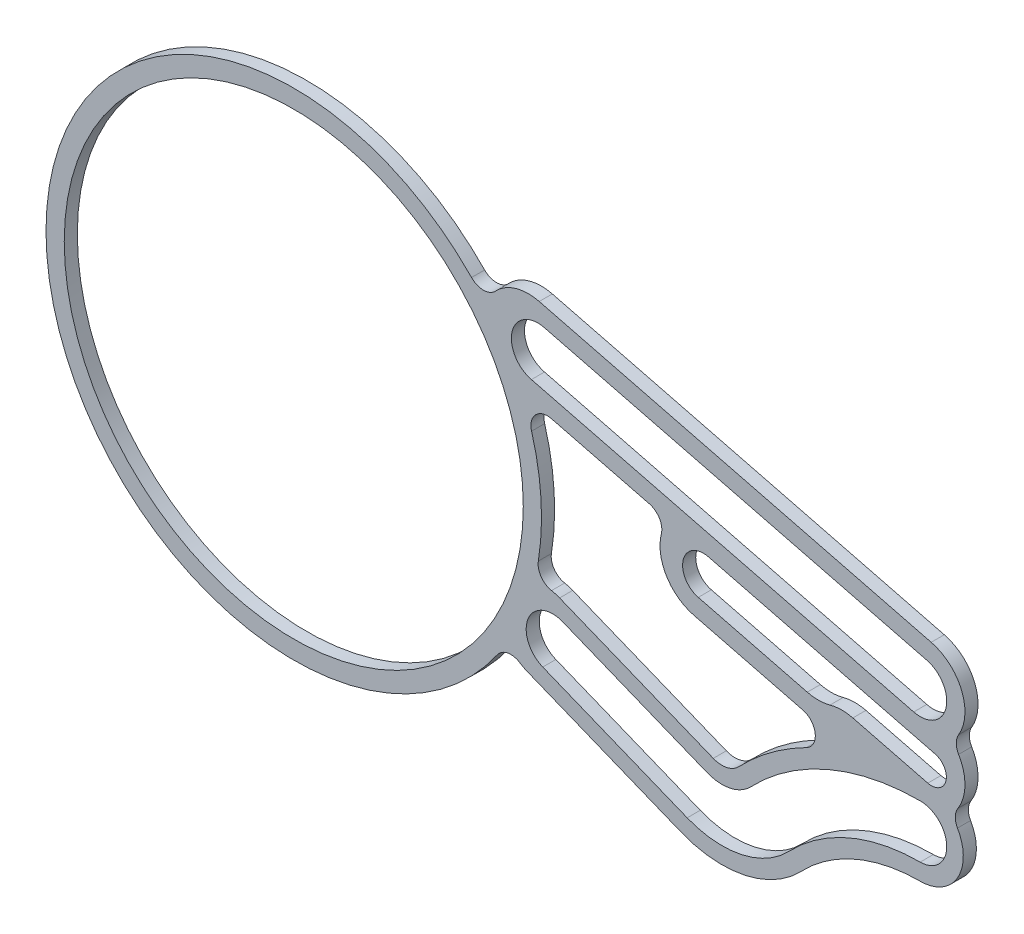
ISO-10303-21;
HEADER;
FILE_DESCRIPTION(('STEP AP214'),'2;1');
FILE_NAME('part.step','',(''),(''),'','','');
FILE_SCHEMA(('AUTOMOTIVE_DESIGN { 1 0 10303 214 1 1 1 1 }'));
ENDSEC;
DATA;
#1=APPLICATION_CONTEXT('core data for automotive mechanical design processes');
#2=APPLICATION_PROTOCOL_DEFINITION('international standard','automotive_design',2000,#1);
#3=PRODUCT_CONTEXT('',#1,'mechanical');
#4=PRODUCT('Part','Part','',(#3));
#5=PRODUCT_RELATED_PRODUCT_CATEGORY('part','',(#4));
#6=PRODUCT_DEFINITION_FORMATION('','',#4);
#7=PRODUCT_DEFINITION_CONTEXT('part definition',#1,'design');
#8=PRODUCT_DEFINITION('design','',#6,#7);
#9=PRODUCT_DEFINITION_SHAPE('','',#8);
#10=(LENGTH_UNIT() NAMED_UNIT(*) SI_UNIT(.MILLI.,.METRE.));
#11=(NAMED_UNIT(*) PLANE_ANGLE_UNIT() SI_UNIT($,.RADIAN.));
#12=(NAMED_UNIT(*) SI_UNIT($,.STERADIAN.) SOLID_ANGLE_UNIT());
#13=UNCERTAINTY_MEASURE_WITH_UNIT(LENGTH_MEASURE(1.E-05),#10,'distance_accuracy_value','');
#14=(GEOMETRIC_REPRESENTATION_CONTEXT(3) GLOBAL_UNCERTAINTY_ASSIGNED_CONTEXT((#13)) GLOBAL_UNIT_ASSIGNED_CONTEXT((#10,
#11,#12)) REPRESENTATION_CONTEXT('',''));
#15=CARTESIAN_POINT('',(0.,0.,0.));
#16=DIRECTION('',(0.,0.,1.));
#17=DIRECTION('',(1.,0.,0.));
#18=AXIS2_PLACEMENT_3D('',#15,#16,#17);
#19=CARTESIAN_POINT('',(31.2982774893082,-84.1015178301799,-1.74));
#20=DIRECTION('',(0.,0.,-1.));
#21=DIRECTION('',(-1.,0.,0.));
#22=AXIS2_PLACEMENT_3D('',#19,#20,#21);
#23=PLANE('',#22);
#24=DIRECTION('',(0.969451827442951,-0.245281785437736,0.));
#25=VECTOR('',#24,1.);
#26=CARTESIAN_POINT('',(42.3377391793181,-75.5283794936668,-1.74));
#27=LINE('',#26,#25);
#28=CARTESIAN_POINT('',(42.3377391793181,-75.5283794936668,-1.74));
#29=VERTEX_POINT('',#28);
#30=CARTESIAN_POINT('',(48.9155918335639,-77.1926472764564,-1.74));
#31=VERTEX_POINT('',#30);
#32=EDGE_CURVE('E482',#29,#31,#27,.T.);
#33=ORIENTED_EDGE('',*,*,#32,.F.);
#34=CARTESIAN_POINT('',(43.,-72.9108595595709,-1.74));
#35=DIRECTION('',(0.,0.,1.));
#36=DIRECTION('',(-1.,0.,0.));
#37=AXIS2_PLACEMENT_3D('',#34,#35,#36);
#38=CIRCLE('',#37,2.7);
#39=CARTESIAN_POINT('',(40.3796260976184,-72.2599827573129,-1.74));
#40=VERTEX_POINT('',#39);
#41=EDGE_CURVE('E480',#40,#29,#38,.T.);
#42=ORIENTED_EDGE('',*,*,#41,.F.);
#43=CARTESIAN_POINT('',(39.4091172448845,-72.0189172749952,-1.74));
#44=DIRECTION('',(0.,0.,-1.));
#45=DIRECTION('',(-1.,0.,0.));
#46=AXIS2_PLACEMENT_3D('',#43,#44,#45);
#47=CIRCLE('',#46,0.999999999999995);
#48=CARTESIAN_POINT('',(39.6543990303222,-71.0494654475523,-1.74));
#49=VERTEX_POINT('',#48);
#50=EDGE_CURVE('E504',#49,#40,#47,.T.);
#51=ORIENTED_EDGE('',*,*,#50,.F.);
#52=DIRECTION('',(0.96945182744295,-0.245281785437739,0.));
#53=VECTOR('',#52,1.);
#54=CARTESIAN_POINT('',(33.7550383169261,-69.5568634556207,-1.74));
#55=LINE('',#54,#53);
#56=CARTESIAN_POINT('',(33.7550383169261,-69.5568634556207,-1.74));
#57=VERTEX_POINT('',#56);
#58=EDGE_CURVE('E501',#57,#49,#55,.T.);
#59=ORIENTED_EDGE('',*,*,#58,.F.);
#60=CARTESIAN_POINT('',(33.5097565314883,-70.5263152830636,-1.74));
#61=DIRECTION('',(0.,0.,-1.));
#62=DIRECTION('',(-1.,0.,0.));
#63=AXIS2_PLACEMENT_3D('',#60,#61,#62);
#64=CIRCLE('',#63,0.999999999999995);
#65=CARTESIAN_POINT('',(32.5498971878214,-70.8067970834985,-1.74));
#66=VERTEX_POINT('',#65);
#67=EDGE_CURVE('E499',#66,#57,#64,.T.);
#68=ORIENTED_EDGE('',*,*,#67,.F.);
#69=CARTESIAN_POINT('',(18.2,-75.,-1.74));
#70=DIRECTION('',(0.,0.,1.));
#71=DIRECTION('',(-1.,0.,0.));
#72=AXIS2_PLACEMENT_3D('',#69,#70,#71);
#73=CIRCLE('',#72,14.95);
#74=CARTESIAN_POINT('',(32.957438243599,-77.391760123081,-1.74));
#75=VERTEX_POINT('',#74);
#76=EDGE_CURVE('E497',#75,#66,#73,.T.);
#77=ORIENTED_EDGE('',*,*,#76,.F.);
#78=CARTESIAN_POINT('',(33.9445578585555,-77.5517440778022,-1.74));
#79=DIRECTION('',(0.,0.,-1.));
#80=DIRECTION('',(-1.,0.,0.));
#81=AXIS2_PLACEMENT_3D('',#78,#79,#80);
#82=CIRCLE('',#81,0.999999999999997);
#83=CARTESIAN_POINT('',(33.7562744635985,-78.5338588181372,-1.74));
#84=VERTEX_POINT('',#83);
#85=EDGE_CURVE('E495',#84,#75,#82,.T.);
#86=ORIENTED_EDGE('',*,*,#85,.F.);
#87=CARTESIAN_POINT('',(33.2667376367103,-81.0873571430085,-1.74));
#88=DIRECTION('',(0.,0.,1.));
#89=DIRECTION('',(-1.,0.,0.));
#90=AXIS2_PLACEMENT_3D('',#87,#88,#89);
#91=CIRCLE('',#90,2.59999999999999);
#92=CARTESIAN_POINT('',(34.2407147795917,-78.6766791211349,-1.74));
#93=VERTEX_POINT('',#92);
#94=EDGE_CURVE('E493',#93,#84,#91,.T.);
#95=ORIENTED_EDGE('',*,*,#94,.F.);
#96=DIRECTION('',(-0.92718385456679,0.374606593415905,0.));
#97=VECTOR('',#96,1.);
#98=CARTESIAN_POINT('',(43.5125533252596,-82.4227450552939,-1.74));
#99=LINE('',#98,#97);
#100=CARTESIAN_POINT('',(43.5125533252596,-82.4227450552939,-1.74));
#101=VERTEX_POINT('',#100);
#102=EDGE_CURVE('E491',#101,#93,#99,.T.);
#103=ORIENTED_EDGE('',*,*,#102,.F.);
#104=CARTESIAN_POINT('',(44.0370025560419,-81.1246876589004,-1.74));
#105=DIRECTION('',(0.,0.,-1.));
#106=DIRECTION('',(-1.,0.,0.));
#107=AXIS2_PLACEMENT_3D('',#104,#105,#106);
#108=CIRCLE('',#107,1.40000000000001);
#109=CARTESIAN_POINT('',(45.0504803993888,-82.0905358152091,-1.74));
#110=VERTEX_POINT('',#109);
#111=EDGE_CURVE('E489',#110,#101,#108,.T.);
#112=ORIENTED_EDGE('',*,*,#111,.F.);
#113=CARTESIAN_POINT('',(56.,-92.5254687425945,-1.74));
#114=DIRECTION('',(0.,0.,1.));
#115=DIRECTION('',(-1.,0.,0.));
#116=AXIS2_PLACEMENT_3D('',#113,#114,#115);
#117=CIRCLE('',#116,15.1254687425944);
#118=CARTESIAN_POINT('',(49.1248512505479,-79.0528248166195,-1.74));
#119=VERTEX_POINT('',#118);
#120=EDGE_CURVE('E487',#119,#110,#117,.T.);
#121=ORIENTED_EDGE('',*,*,#120,.F.);
#122=CARTESIAN_POINT('',(48.6703100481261,-78.1620991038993,-1.74));
#123=DIRECTION('',(0.,0.,-1.));
#124=DIRECTION('',(-1.,0.,0.));
#125=AXIS2_PLACEMENT_3D('',#122,#123,#124);
#126=CIRCLE('',#125,1.);
#127=EDGE_CURVE('E485',#31,#119,#126,.T.);
#128=ORIENTED_EDGE('',*,*,#127,.F.);
#129=EDGE_LOOP('',(#33,#42,#51,#59,#68,#77,#86,#95,#103,#112,#121,#128));
#130=FACE_BOUND('',#129,.T.);
#131=CARTESIAN_POINT('',(31.2982774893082,-84.1015178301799,-1.74));
#132=DIRECTION('',(0.,0.,1.));
#133=DIRECTION('',(-1.,0.,0.));
#134=AXIS2_PLACEMENT_3D('',#131,#132,#133);
#135=CIRCLE('',#134,0.999999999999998);
#136=CARTESIAN_POINT('',(31.8450719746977,-83.2642509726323,-1.74));
#137=VERTEX_POINT('',#136);
#138=CARTESIAN_POINT('',(30.4770688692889,-83.5308897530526,-1.74));
#139=VERTEX_POINT('',#138);
#140=EDGE_CURVE('E567',#137,#139,#135,.T.);
#141=ORIENTED_EDGE('',*,*,#140,.T.);
#142=CARTESIAN_POINT('',(18.2,-75.,-1.74));
#143=DIRECTION('',(0.,0.,-1.));
#144=DIRECTION('',(-1.,0.,0.));
#145=AXIS2_PLACEMENT_3D('',#142,#143,#144);
#146=CIRCLE('',#145,14.95);
#147=CARTESIAN_POINT('',(28.9279027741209,-64.5877667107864,-1.74));
#148=VERTEX_POINT('',#147);
#149=EDGE_CURVE('E570',#139,#148,#146,.T.);
#150=ORIENTED_EDGE('',*,*,#149,.T.);
#151=CARTESIAN_POINT('',(29.6454882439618,-63.8912962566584,-1.74));
#152=DIRECTION('',(0.,0.,1.));
#153=DIRECTION('',(-1.,0.,0.));
#154=AXIS2_PLACEMENT_3D('',#151,#152,#153);
#155=CIRCLE('',#154,1.00000000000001);
#156=CARTESIAN_POINT('',(30.3764373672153,-64.5737282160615,-1.74));
#157=VERTEX_POINT('',#156);
#158=EDGE_CURVE('E573',#148,#157,#155,.T.);
#159=ORIENTED_EDGE('',*,*,#158,.T.);
#160=CARTESIAN_POINT('',(32.35,-66.41629450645,-1.74));
#161=DIRECTION('',(0.,0.,-1.));
#162=DIRECTION('',(-1.,0.,0.));
#163=AXIS2_PLACEMENT_3D('',#160,#161,#162);
#164=CIRCLE('',#163,2.70000000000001);
#165=CARTESIAN_POINT('',(33.0122608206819,-63.7987745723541,-1.74));
#166=VERTEX_POINT('',#165);
#167=EDGE_CURVE('E575',#157,#166,#164,.T.);
#168=ORIENTED_EDGE('',*,*,#167,.T.);
#169=DIRECTION('',(0.969451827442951,-0.245281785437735,0.));
#170=VECTOR('',#169,1.);
#171=CARTESIAN_POINT('',(33.0122608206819,-63.7987745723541,-1.74));
#172=LINE('',#171,#170);
#173=CARTESIAN_POINT('',(56.6622608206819,-69.782480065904,-1.74));
#174=VERTEX_POINT('',#173);
#175=EDGE_CURVE('E577',#166,#174,#172,.T.);
#176=ORIENTED_EDGE('',*,*,#175,.T.);
#177=CARTESIAN_POINT('',(56.,-72.4,-1.74));
#178=DIRECTION('',(0.,0.,-1.));
#179=DIRECTION('',(-1.,0.,0.));
#180=AXIS2_PLACEMENT_3D('',#177,#178,#179);
#181=CIRCLE('',#180,2.70000000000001);
#182=CARTESIAN_POINT('',(58.3168200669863,-73.7864864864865,-1.74));
#183=VERTEX_POINT('',#182);
#184=EDGE_CURVE('E579',#174,#183,#181,.T.);
#185=ORIENTED_EDGE('',*,*,#184,.T.);
#186=CARTESIAN_POINT('',(59.1749015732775,-74.3,-1.74));
#187=DIRECTION('',(0.,0.,1.));
#188=DIRECTION('',(-1.,0.,0.));
#189=AXIS2_PLACEMENT_3D('',#186,#187,#188);
#190=CIRCLE('',#189,1.);
#191=CARTESIAN_POINT('',(58.3168200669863,-74.8135135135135,-1.74));
#192=VERTEX_POINT('',#191);
#193=EDGE_CURVE('E581',#183,#192,#190,.T.);
#194=ORIENTED_EDGE('',*,*,#193,.T.);
#195=CARTESIAN_POINT('',(56.,-76.2,-1.74));
#196=DIRECTION('',(0.,0.,-1.));
#197=DIRECTION('',(-1.,0.,0.));
#198=AXIS2_PLACEMENT_3D('',#195,#196,#197);
#199=CIRCLE('',#198,2.70000000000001);
#200=CARTESIAN_POINT('',(58.2734066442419,-77.6565789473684,-1.74));
#201=VERTEX_POINT('',#200);
#202=EDGE_CURVE('E583',#192,#201,#199,.T.);
#203=ORIENTED_EDGE('',*,*,#202,.T.);
#204=CARTESIAN_POINT('',(59.1154091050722,-78.196052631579,-1.74));
#205=DIRECTION('',(0.,0.,1.));
#206=DIRECTION('',(-1.,0.,0.));
#207=AXIS2_PLACEMENT_3D('',#204,#205,#206);
#208=CIRCLE('',#207,1.);
#209=CARTESIAN_POINT('',(58.2500176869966,-78.697149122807,-1.74));
#210=VERTEX_POINT('',#209);
#211=EDGE_CURVE('E585',#201,#210,#208,.T.);
#212=ORIENTED_EDGE('',*,*,#211,.T.);
#213=CARTESIAN_POINT('',(56.,-80.,-1.74));
#214=DIRECTION('',(0.,0.,-1.));
#215=DIRECTION('',(-1.,0.,0.));
#216=AXIS2_PLACEMENT_3D('',#213,#214,#215);
#217=CIRCLE('',#216,2.60000000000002);
#218=CARTESIAN_POINT('',(56.,-82.6,-1.74));
#219=VERTEX_POINT('',#218);
#220=EDGE_CURVE('E587',#210,#219,#217,.T.);
#221=ORIENTED_EDGE('',*,*,#220,.T.);
#222=CARTESIAN_POINT('',(56.,-92.5254687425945,-1.74));
#223=DIRECTION('',(0.,0.,1.));
#224=DIRECTION('',(-1.,0.,0.));
#225=AXIS2_PLACEMENT_3D('',#222,#223,#224);
#226=CIRCLE('',#225,9.92546874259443);
#227=CARTESIAN_POINT('',(48.8148266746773,-85.6779718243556,-1.74));
#228=VERTEX_POINT('',#227);
#229=EDGE_CURVE('E589',#219,#228,#226,.T.);
#230=ORIENTED_EDGE('',*,*,#229,.T.);
#231=CARTESIAN_POINT('',(44.0370025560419,-81.1246876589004,-1.74));
#232=DIRECTION('',(0.,0.,-1.));
#233=DIRECTION('',(-1.,0.,0.));
#234=AXIS2_PLACEMENT_3D('',#231,#232,#233);
#235=CIRCLE('',#234,6.60000000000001);
#236=CARTESIAN_POINT('',(41.5645990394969,-87.2441010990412,-1.74));
#237=VERTEX_POINT('',#236);
#238=EDGE_CURVE('E591',#228,#237,#235,.T.);
#239=ORIENTED_EDGE('',*,*,#238,.T.);
#240=DIRECTION('',(-0.92718385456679,0.374606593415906,0.));
#241=VECTOR('',#240,1.);
#242=CARTESIAN_POINT('',(41.5645990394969,-87.2441010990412,-1.74));
#243=LINE('',#242,#241);
#244=CARTESIAN_POINT('',(32.292760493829,-83.4980351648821,-1.74));
#245=VERTEX_POINT('',#244);
#246=EDGE_CURVE('E593',#237,#245,#243,.T.);
#247=ORIENTED_EDGE('',*,*,#246,.T.);
#248=CARTESIAN_POINT('',(33.2667376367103,-81.0873571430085,-1.74));
#249=DIRECTION('',(0.,0.,-1.));
#250=DIRECTION('',(-1.,0.,0.));
#251=AXIS2_PLACEMENT_3D('',#248,#249,#250);
#252=CIRCLE('',#251,2.59999999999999);
#253=EDGE_CURVE('E595',#245,#137,#252,.T.);
#254=ORIENTED_EDGE('',*,*,#253,.T.);
#255=EDGE_LOOP('',(#141,#150,#159,#168,#176,#185,#194,#203,#212,#221,#230,#239,#247,#254));
#256=FACE_BOUND('',#255,.T.);
#257=CARTESIAN_POINT('',(18.2,-75.,-1.74));
#258=DIRECTION('',(0.,0.,-1.));
#259=DIRECTION('',(-1.,0.,0.));
#260=AXIS2_PLACEMENT_3D('',#257,#258,#259);
#261=CIRCLE('',#260,13.85);
#262=CARTESIAN_POINT('',(32.05,-75.,-1.74));
#263=VERTEX_POINT('',#262);
#264=EDGE_CURVE('E474',#263,#263,#261,.T.);
#265=ORIENTED_EDGE('',*,*,#264,.F.);
#266=EDGE_LOOP('',(#265));
#267=FACE_BOUND('',#266,.T.);
#268=CARTESIAN_POINT('',(49.8476626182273,-73.5087303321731,-1.74));
#269=DIRECTION('',(0.,0.,-1.));
#270=DIRECTION('',(-1.,0.,0.));
#271=AXIS2_PLACEMENT_3D('',#268,#269,#270);
#272=CIRCLE('',#271,2.7);
#273=CARTESIAN_POINT('',(50.5601110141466,-76.1130377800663,-1.74));
#274=VERTEX_POINT('',#273);
#275=CARTESIAN_POINT('',(49.1854017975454,-76.1262502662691,-1.74));
#276=VERTEX_POINT('',#275);
#277=EDGE_CURVE('E424',#274,#276,#272,.T.);
#278=ORIENTED_EDGE('',*,*,#277,.F.);
#279=CARTESIAN_POINT('',(51.2725594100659,-78.7173452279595,-1.74));
#280=DIRECTION('',(0.,0.,1.));
#281=DIRECTION('',(1.,0.,0.));
#282=AXIS2_PLACEMENT_3D('',#279,#280,#281);
#283=CIRCLE('',#282,2.70000000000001);
#284=CARTESIAN_POINT('',(51.9348202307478,-76.0998252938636,-1.74));
#285=VERTEX_POINT('',#284);
#286=EDGE_CURVE('E422',#285,#274,#283,.T.);
#287=ORIENTED_EDGE('',*,*,#286,.F.);
#288=DIRECTION('',(-0.969451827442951,0.245281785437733,0.));
#289=VECTOR('',#288,1.);
#290=CARTESIAN_POINT('',(51.9348202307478,-76.0998252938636,-1.74));
#291=LINE('',#290,#289);
#292=CARTESIAN_POINT('',(56.4578626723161,-77.2442038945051,-1.74));
#293=VERTEX_POINT('',#292);
#294=EDGE_CURVE('E436',#293,#285,#291,.T.);
#295=ORIENTED_EDGE('',*,*,#294,.F.);
#296=CARTESIAN_POINT('',(56.6786162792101,-76.3716972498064,-1.74));
#297=DIRECTION('',(0.,0.,-1.));
#298=DIRECTION('',(-1.,0.,0.));
#299=AXIS2_PLACEMENT_3D('',#296,#297,#298);
#300=CIRCLE('',#299,0.89999999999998);
#301=CARTESIAN_POINT('',(56.899369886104,-75.4991906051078,-1.74));
#302=VERTEX_POINT('',#301);
#303=EDGE_CURVE('E433',#302,#293,#300,.T.);
#304=ORIENTED_EDGE('',*,*,#303,.F.);
#305=DIRECTION('',(0.96945182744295,-0.245281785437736,0.));
#306=VECTOR('',#305,1.);
#307=CARTESIAN_POINT('',(56.899369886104,-75.4991906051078,-1.74));
#308=LINE('',#307,#306);
#309=CARTESIAN_POINT('',(43.220753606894,-72.0383529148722,-1.74));
#310=VERTEX_POINT('',#309);
#311=EDGE_CURVE('E431',#310,#302,#308,.T.);
#312=ORIENTED_EDGE('',*,*,#311,.F.);
#313=CARTESIAN_POINT('',(42.9141513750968,-73.2501676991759,-1.74));
#314=DIRECTION('',(0.,0.,-1.));
#315=DIRECTION('',(1.,0.,0.));
#316=AXIS2_PLACEMENT_3D('',#313,#314,#315);
#317=CIRCLE('',#316,1.24999999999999);
#318=CARTESIAN_POINT('',(42.6075491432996,-74.4619824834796,-1.74));
#319=VERTEX_POINT('',#318);
#320=EDGE_CURVE('E429',#319,#310,#317,.T.);
#321=ORIENTED_EDGE('',*,*,#320,.F.);
#322=DIRECTION('',(-0.969451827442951,0.245281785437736,0.));
#323=VECTOR('',#322,1.);
#324=CARTESIAN_POINT('',(42.6075491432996,-74.4619824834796,-1.74));
#325=LINE('',#324,#323);
#326=EDGE_CURVE('E427',#276,#319,#325,.T.);
#327=ORIENTED_EDGE('',*,*,#326,.F.);
#328=EDGE_LOOP('',(#278,#287,#295,#304,#312,#321,#327));
#329=FACE_BOUND('',#328,.T.);
#330=DIRECTION('',(-0.96945182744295,0.245281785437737,0.));
#331=VECTOR('',#330,1.);
#332=CARTESIAN_POINT('',(55.6075491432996,-73.9511229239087,-1.74));
#333=LINE('',#332,#331);
#334=CARTESIAN_POINT('',(55.6075491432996,-73.9511229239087,-1.74));
#335=VERTEX_POINT('',#334);
#336=CARTESIAN_POINT('',(32.5392202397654,-68.1145865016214,-1.74));
#337=VERTEX_POINT('',#336);
#338=EDGE_CURVE('E393',#335,#337,#333,.T.);
#339=ORIENTED_EDGE('',*,*,#338,.F.);
#340=CARTESIAN_POINT('',(56.,-72.4,-1.74));
#341=DIRECTION('',(0.,0.,-1.));
#342=DIRECTION('',(-1.,0.,0.));
#343=AXIS2_PLACEMENT_3D('',#340,#341,#342);
#344=CIRCLE('',#343,1.60000000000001);
#345=CARTESIAN_POINT('',(56.3924508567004,-70.8488770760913,-1.74));
#346=VERTEX_POINT('',#345);
#347=EDGE_CURVE('E391',#346,#335,#344,.T.);
#348=ORIENTED_EDGE('',*,*,#347,.F.);
#349=DIRECTION('',(0.969451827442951,-0.245281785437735,0.));
#350=VECTOR('',#349,1.);
#351=CARTESIAN_POINT('',(33.3241219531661,-65.0123406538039,-1.74));
#352=LINE('',#351,#350);
#353=CARTESIAN_POINT('',(33.3241219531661,-65.012340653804,-1.74));
#354=VERTEX_POINT('',#353);
#355=EDGE_CURVE('E399',#354,#346,#352,.T.);
#356=ORIENTED_EDGE('',*,*,#355,.F.);
#357=CARTESIAN_POINT('',(32.9316710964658,-66.5634635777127,-1.74));
#358=DIRECTION('',(0.,0.,-1.));
#359=DIRECTION('',(1.,0.,0.));
#360=AXIS2_PLACEMENT_3D('',#357,#358,#359);
#361=CIRCLE('',#360,1.59999999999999);
#362=EDGE_CURVE('E396',#337,#354,#361,.T.);
#363=ORIENTED_EDGE('',*,*,#362,.F.);
#364=EDGE_LOOP('',(#339,#348,#356,#363));
#365=FACE_BOUND('',#364,.T.);
#366=CARTESIAN_POINT('',(56.,-80.,-1.74));
#367=DIRECTION('',(0.,0.,-1.));
#368=DIRECTION('',(-1.,0.,0.));
#369=AXIS2_PLACEMENT_3D('',#366,#367,#368);
#370=CIRCLE('',#369,1.59999999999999);
#371=CARTESIAN_POINT('',(56.,-78.4,-1.74));
#372=VERTEX_POINT('',#371);
#373=CARTESIAN_POINT('',(56.,-81.6,-1.74));
#374=VERTEX_POINT('',#373);
#375=EDGE_CURVE('E334',#372,#374,#370,.T.);
#376=ORIENTED_EDGE('',*,*,#375,.F.);
#377=CARTESIAN_POINT('',(56.,-92.5254687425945,-1.74));
#378=DIRECTION('',(0.,0.,-1.));
#379=DIRECTION('',(-1.,0.,0.));
#380=AXIS2_PLACEMENT_3D('',#377,#378,#379);
#381=CIRCLE('',#380,14.1254687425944);
#382=CARTESIAN_POINT('',(45.7743931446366,-82.7804273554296,-1.74));
#383=VERTEX_POINT('',#382);
#384=EDGE_CURVE('E326',#383,#372,#381,.T.);
#385=ORIENTED_EDGE('',*,*,#384,.F.);
#386=CARTESIAN_POINT('',(44.0370025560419,-81.1246876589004,-1.74));
#387=DIRECTION('',(0.,0.,1.));
#388=DIRECTION('',(-1.,0.,0.));
#389=AXIS2_PLACEMENT_3D('',#386,#387,#388);
#390=CIRCLE('',#389,2.40000000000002);
#391=CARTESIAN_POINT('',(43.1379467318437,-83.3499289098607,-1.74));
#392=VERTEX_POINT('',#391);
#393=EDGE_CURVE('E359',#392,#383,#390,.T.);
#394=ORIENTED_EDGE('',*,*,#393,.F.);
#395=DIRECTION('',(0.92718385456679,-0.374606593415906,0.));
#396=VECTOR('',#395,1.);
#397=CARTESIAN_POINT('',(34.4224184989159,-79.8286269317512,-1.74));
#398=LINE('',#397,#396);
#399=CARTESIAN_POINT('',(34.4224184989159,-79.8286269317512,-1.74));
#400=VERTEX_POINT('',#399);
#401=EDGE_CURVE('E357',#400,#392,#398,.T.);
#402=ORIENTED_EDGE('',*,*,#401,.F.);
#403=CARTESIAN_POINT('',(33.8230479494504,-81.312121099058,-1.74));
#404=DIRECTION('',(0.,0.,-1.));
#405=DIRECTION('',(1.,0.,0.));
#406=AXIS2_PLACEMENT_3D('',#403,#404,#405);
#407=CIRCLE('',#406,1.59999999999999);
#408=CARTESIAN_POINT('',(33.223677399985,-82.7956152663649,-1.74));
#409=VERTEX_POINT('',#408);
#410=EDGE_CURVE('E355',#409,#400,#407,.T.);
#411=ORIENTED_EDGE('',*,*,#410,.F.);
#412=DIRECTION('',(-0.927183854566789,0.374606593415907,0.));
#413=VECTOR('',#412,1.);
#414=CARTESIAN_POINT('',(41.9392056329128,-86.3169172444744,-1.74));
#415=LINE('',#414,#413);
#416=CARTESIAN_POINT('',(41.9392056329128,-86.3169172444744,-1.74));
#417=VERTEX_POINT('',#416);
#418=EDGE_CURVE('E353',#417,#409,#415,.T.);
#419=ORIENTED_EDGE('',*,*,#418,.F.);
#420=CARTESIAN_POINT('',(44.0370025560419,-81.1246876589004,-1.74));
#421=DIRECTION('',(0.,0.,-1.));
#422=DIRECTION('',(-1.,0.,0.));
#423=AXIS2_PLACEMENT_3D('',#420,#421,#422);
#424=CIRCLE('',#423,5.6);
#425=CARTESIAN_POINT('',(48.0909139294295,-84.9880802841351,-1.74));
#426=VERTEX_POINT('',#425);
#427=EDGE_CURVE('E349',#426,#417,#424,.T.);
#428=ORIENTED_EDGE('',*,*,#427,.F.);
#429=CARTESIAN_POINT('',(56.,-92.5254687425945,-1.74));
#430=DIRECTION('',(0.,0.,1.));
#431=DIRECTION('',(-1.,0.,0.));
#432=AXIS2_PLACEMENT_3D('',#429,#430,#431);
#433=CIRCLE('',#432,10.9254687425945);
#434=EDGE_CURVE('E347',#374,#426,#433,.T.);
#435=ORIENTED_EDGE('',*,*,#434,.F.);
#436=EDGE_LOOP('',(#376,#385,#394,#402,#411,#419,#428,#435));
#437=FACE_BOUND('',#436,.T.);
#438=ADVANCED_FACE('F39',(#130,#256,#267,#329,#365,#437),#23,.T.);
#439=CARTESIAN_POINT('',(31.2982774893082,-84.1015178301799,-0.95));
#440=DIRECTION('',(0.,0.,-1.));
#441=DIRECTION('',(-1.,0.,0.));
#442=AXIS2_PLACEMENT_3D('',#439,#440,#441);
#443=PLANE('',#442);
#444=CARTESIAN_POINT('',(56.,-72.4,-0.95));
#445=DIRECTION('',(0.,0.,-1.));
#446=DIRECTION('',(-1.,0.,0.));
#447=AXIS2_PLACEMENT_3D('',#444,#445,#446);
#448=CIRCLE('',#447,1.60000000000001);
#449=CARTESIAN_POINT('',(56.3924508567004,-70.8488770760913,-0.95));
#450=VERTEX_POINT('',#449);
#451=CARTESIAN_POINT('',(55.6075491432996,-73.9511229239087,-0.95));
#452=VERTEX_POINT('',#451);
#453=EDGE_CURVE('E342',#450,#452,#448,.T.);
#454=ORIENTED_EDGE('',*,*,#453,.T.);
#455=DIRECTION('',(-0.96945182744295,0.245281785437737,0.));
#456=VECTOR('',#455,1.);
#457=CARTESIAN_POINT('',(55.6075491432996,-73.9511229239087,-0.95));
#458=LINE('',#457,#456);
#459=CARTESIAN_POINT('',(32.5392202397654,-68.1145865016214,-0.95));
#460=VERTEX_POINT('',#459);
#461=EDGE_CURVE('E404',#452,#460,#458,.T.);
#462=ORIENTED_EDGE('',*,*,#461,.T.);
#463=CARTESIAN_POINT('',(32.9316710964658,-66.5634635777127,-0.95));
#464=DIRECTION('',(0.,0.,-1.));
#465=DIRECTION('',(1.,0.,0.));
#466=AXIS2_PLACEMENT_3D('',#463,#464,#465);
#467=CIRCLE('',#466,1.59999999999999);
#468=CARTESIAN_POINT('',(33.3241219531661,-65.0123406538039,-0.95));
#469=VERTEX_POINT('',#468);
#470=EDGE_CURVE('E407',#460,#469,#467,.T.);
#471=ORIENTED_EDGE('',*,*,#470,.T.);
#472=DIRECTION('',(0.969451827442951,-0.245281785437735,0.));
#473=VECTOR('',#472,1.);
#474=CARTESIAN_POINT('',(33.3241219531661,-65.0123406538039,-0.95));
#475=LINE('',#474,#473);
#476=EDGE_CURVE('E394',#469,#450,#475,.T.);
#477=ORIENTED_EDGE('',*,*,#476,.T.);
#478=EDGE_LOOP('',(#454,#462,#471,#477));
#479=FACE_BOUND('',#478,.T.);
#480=CARTESIAN_POINT('',(18.2,-75.,-0.95));
#481=DIRECTION('',(0.,0.,-1.));
#482=DIRECTION('',(-1.,0.,0.));
#483=AXIS2_PLACEMENT_3D('',#480,#481,#482);
#484=CIRCLE('',#483,13.85);
#485=CARTESIAN_POINT('',(32.05,-75.,-0.95));
#486=VERTEX_POINT('',#485);
#487=EDGE_CURVE('E473',#486,#486,#484,.T.);
#488=ORIENTED_EDGE('',*,*,#487,.T.);
#489=EDGE_LOOP('',(#488));
#490=FACE_BOUND('',#489,.T.);
#491=CARTESIAN_POINT('',(43.,-72.9108595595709,-0.95));
#492=DIRECTION('',(0.,0.,1.));
#493=DIRECTION('',(-1.,0.,0.));
#494=AXIS2_PLACEMENT_3D('',#491,#492,#493);
#495=CIRCLE('',#494,2.7);
#496=CARTESIAN_POINT('',(40.3796260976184,-72.2599827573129,-0.95));
#497=VERTEX_POINT('',#496);
#498=CARTESIAN_POINT('',(42.3377391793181,-75.5283794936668,-0.95));
#499=VERTEX_POINT('',#498);
#500=EDGE_CURVE('E477',#497,#499,#495,.T.);
#501=ORIENTED_EDGE('',*,*,#500,.T.);
#502=DIRECTION('',(0.969451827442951,-0.245281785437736,0.));
#503=VECTOR('',#502,1.);
#504=CARTESIAN_POINT('',(42.3377391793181,-75.5283794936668,-0.95));
#505=LINE('',#504,#503);
#506=CARTESIAN_POINT('',(48.9155918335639,-77.1926472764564,-0.95));
#507=VERTEX_POINT('',#506);
#508=EDGE_CURVE('E509',#499,#507,#505,.T.);
#509=ORIENTED_EDGE('',*,*,#508,.T.);
#510=CARTESIAN_POINT('',(48.6703100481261,-78.1620991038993,-0.95));
#511=DIRECTION('',(0.,0.,-1.));
#512=DIRECTION('',(-1.,0.,0.));
#513=AXIS2_PLACEMENT_3D('',#510,#511,#512);
#514=CIRCLE('',#513,1.);
#515=CARTESIAN_POINT('',(49.1248512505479,-79.0528248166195,-0.95));
#516=VERTEX_POINT('',#515);
#517=EDGE_CURVE('E512',#507,#516,#514,.T.);
#518=ORIENTED_EDGE('',*,*,#517,.T.);
#519=CARTESIAN_POINT('',(56.,-92.5254687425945,-0.95));
#520=DIRECTION('',(0.,0.,1.));
#521=DIRECTION('',(-1.,0.,0.));
#522=AXIS2_PLACEMENT_3D('',#519,#520,#521);
#523=CIRCLE('',#522,15.1254687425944);
#524=CARTESIAN_POINT('',(45.0504803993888,-82.0905358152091,-0.95));
#525=VERTEX_POINT('',#524);
#526=EDGE_CURVE('E515',#516,#525,#523,.T.);
#527=ORIENTED_EDGE('',*,*,#526,.T.);
#528=CARTESIAN_POINT('',(44.0370025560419,-81.1246876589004,-0.95));
#529=DIRECTION('',(0.,0.,-1.));
#530=DIRECTION('',(-1.,0.,0.));
#531=AXIS2_PLACEMENT_3D('',#528,#529,#530);
#532=CIRCLE('',#531,1.40000000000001);
#533=CARTESIAN_POINT('',(43.5125533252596,-82.4227450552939,-0.95));
#534=VERTEX_POINT('',#533);
#535=EDGE_CURVE('E518',#525,#534,#532,.T.);
#536=ORIENTED_EDGE('',*,*,#535,.T.);
#537=DIRECTION('',(-0.92718385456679,0.374606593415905,0.));
#538=VECTOR('',#537,1.);
#539=CARTESIAN_POINT('',(43.5125533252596,-82.4227450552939,-0.95));
#540=LINE('',#539,#538);
#541=CARTESIAN_POINT('',(34.2407147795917,-78.6766791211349,-0.95));
#542=VERTEX_POINT('',#541);
#543=EDGE_CURVE('E521',#534,#542,#540,.T.);
#544=ORIENTED_EDGE('',*,*,#543,.T.);
#545=CARTESIAN_POINT('',(33.2667376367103,-81.0873571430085,-0.95));
#546=DIRECTION('',(0.,0.,1.));
#547=DIRECTION('',(-1.,0.,0.));
#548=AXIS2_PLACEMENT_3D('',#545,#546,#547);
#549=CIRCLE('',#548,2.59999999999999);
#550=CARTESIAN_POINT('',(33.7562744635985,-78.5338588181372,-0.95));
#551=VERTEX_POINT('',#550);
#552=EDGE_CURVE('E524',#542,#551,#549,.T.);
#553=ORIENTED_EDGE('',*,*,#552,.T.);
#554=CARTESIAN_POINT('',(33.9445578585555,-77.5517440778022,-0.95));
#555=DIRECTION('',(0.,0.,-1.));
#556=DIRECTION('',(-1.,0.,0.));
#557=AXIS2_PLACEMENT_3D('',#554,#555,#556);
#558=CIRCLE('',#557,0.999999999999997);
#559=CARTESIAN_POINT('',(32.957438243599,-77.391760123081,-0.95));
#560=VERTEX_POINT('',#559);
#561=EDGE_CURVE('E527',#551,#560,#558,.T.);
#562=ORIENTED_EDGE('',*,*,#561,.T.);
#563=CARTESIAN_POINT('',(18.2,-75.,-0.95));
#564=DIRECTION('',(0.,0.,1.));
#565=DIRECTION('',(-1.,0.,0.));
#566=AXIS2_PLACEMENT_3D('',#563,#564,#565);
#567=CIRCLE('',#566,14.95);
#568=CARTESIAN_POINT('',(32.5498971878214,-70.8067970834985,-0.95));
#569=VERTEX_POINT('',#568);
#570=EDGE_CURVE('E530',#560,#569,#567,.T.);
#571=ORIENTED_EDGE('',*,*,#570,.T.);
#572=CARTESIAN_POINT('',(33.5097565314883,-70.5263152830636,-0.95));
#573=DIRECTION('',(0.,0.,-1.));
#574=DIRECTION('',(-1.,0.,0.));
#575=AXIS2_PLACEMENT_3D('',#572,#573,#574);
#576=CIRCLE('',#575,0.999999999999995);
#577=CARTESIAN_POINT('',(33.7550383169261,-69.5568634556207,-0.95));
#578=VERTEX_POINT('',#577);
#579=EDGE_CURVE('E533',#569,#578,#576,.T.);
#580=ORIENTED_EDGE('',*,*,#579,.T.);
#581=DIRECTION('',(0.96945182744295,-0.245281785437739,0.));
#582=VECTOR('',#581,1.);
#583=CARTESIAN_POINT('',(33.7550383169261,-69.5568634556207,-0.95));
#584=LINE('',#583,#582);
#585=CARTESIAN_POINT('',(39.6543990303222,-71.0494654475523,-0.95));
#586=VERTEX_POINT('',#585);
#587=EDGE_CURVE('E536',#578,#586,#584,.T.);
#588=ORIENTED_EDGE('',*,*,#587,.T.);
#589=CARTESIAN_POINT('',(39.4091172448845,-72.0189172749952,-0.95));
#590=DIRECTION('',(0.,0.,-1.));
#591=DIRECTION('',(-1.,0.,0.));
#592=AXIS2_PLACEMENT_3D('',#589,#590,#591);
#593=CIRCLE('',#592,0.999999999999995);
#594=EDGE_CURVE('E483',#586,#497,#593,.T.);
#595=ORIENTED_EDGE('',*,*,#594,.T.);
#596=EDGE_LOOP('',(#501,#509,#518,#527,#536,#544,#553,#562,#571,#580,#588,#595));
#597=FACE_BOUND('',#596,.T.);
#598=CARTESIAN_POINT('',(31.2982774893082,-84.1015178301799,-0.95));
#599=DIRECTION('',(0.,0.,1.));
#600=DIRECTION('',(-1.,0.,0.));
#601=AXIS2_PLACEMENT_3D('',#598,#599,#600);
#602=CIRCLE('',#601,0.999999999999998);
#603=CARTESIAN_POINT('',(31.8450719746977,-83.2642509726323,-0.95));
#604=VERTEX_POINT('',#603);
#605=CARTESIAN_POINT('',(30.4770688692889,-83.5308897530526,-0.95));
#606=VERTEX_POINT('',#605);
#607=EDGE_CURVE('E566',#604,#606,#602,.T.);
#608=ORIENTED_EDGE('',*,*,#607,.F.);
#609=CARTESIAN_POINT('',(33.2667376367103,-81.0873571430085,-0.95));
#610=DIRECTION('',(0.,0.,-1.));
#611=DIRECTION('',(-1.,0.,0.));
#612=AXIS2_PLACEMENT_3D('',#609,#610,#611);
#613=CIRCLE('',#612,2.59999999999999);
#614=CARTESIAN_POINT('',(32.292760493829,-83.4980351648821,-0.95));
#615=VERTEX_POINT('',#614);
#616=EDGE_CURVE('E571',#615,#604,#613,.T.);
#617=ORIENTED_EDGE('',*,*,#616,.F.);
#618=DIRECTION('',(-0.92718385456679,0.374606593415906,0.));
#619=VECTOR('',#618,1.);
#620=CARTESIAN_POINT('',(41.5645990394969,-87.2441010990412,-0.95));
#621=LINE('',#620,#619);
#622=CARTESIAN_POINT('',(41.5645990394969,-87.2441010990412,-0.95));
#623=VERTEX_POINT('',#622);
#624=EDGE_CURVE('E622',#623,#615,#621,.T.);
#625=ORIENTED_EDGE('',*,*,#624,.F.);
#626=CARTESIAN_POINT('',(44.0370025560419,-81.1246876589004,-0.95));
#627=DIRECTION('',(0.,0.,-1.));
#628=DIRECTION('',(-1.,0.,0.));
#629=AXIS2_PLACEMENT_3D('',#626,#627,#628);
#630=CIRCLE('',#629,6.60000000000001);
#631=CARTESIAN_POINT('',(48.8148266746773,-85.6779718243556,-0.95));
#632=VERTEX_POINT('',#631);
#633=EDGE_CURVE('E620',#632,#623,#630,.T.);
#634=ORIENTED_EDGE('',*,*,#633,.F.);
#635=CARTESIAN_POINT('',(56.,-92.5254687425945,-0.95));
#636=DIRECTION('',(0.,0.,1.));
#637=DIRECTION('',(-1.,0.,0.));
#638=AXIS2_PLACEMENT_3D('',#635,#636,#637);
#639=CIRCLE('',#638,9.92546874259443);
#640=CARTESIAN_POINT('',(56.,-82.6,-0.95));
#641=VERTEX_POINT('',#640);
#642=EDGE_CURVE('E618',#641,#632,#639,.T.);
#643=ORIENTED_EDGE('',*,*,#642,.F.);
#644=CARTESIAN_POINT('',(56.,-80.,-0.95));
#645=DIRECTION('',(0.,0.,-1.));
#646=DIRECTION('',(-1.,0.,0.));
#647=AXIS2_PLACEMENT_3D('',#644,#645,#646);
#648=CIRCLE('',#647,2.60000000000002);
#649=CARTESIAN_POINT('',(58.2500176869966,-78.697149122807,-0.95));
#650=VERTEX_POINT('',#649);
#651=EDGE_CURVE('E616',#650,#641,#648,.T.);
#652=ORIENTED_EDGE('',*,*,#651,.F.);
#653=CARTESIAN_POINT('',(59.1154091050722,-78.196052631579,-0.95));
#654=DIRECTION('',(0.,0.,1.));
#655=DIRECTION('',(-1.,0.,0.));
#656=AXIS2_PLACEMENT_3D('',#653,#654,#655);
#657=CIRCLE('',#656,1.);
#658=CARTESIAN_POINT('',(58.2734066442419,-77.6565789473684,-0.95));
#659=VERTEX_POINT('',#658);
#660=EDGE_CURVE('E614',#659,#650,#657,.T.);
#661=ORIENTED_EDGE('',*,*,#660,.F.);
#662=CARTESIAN_POINT('',(56.,-76.2,-0.95));
#663=DIRECTION('',(0.,0.,-1.));
#664=DIRECTION('',(-1.,0.,0.));
#665=AXIS2_PLACEMENT_3D('',#662,#663,#664);
#666=CIRCLE('',#665,2.70000000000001);
#667=CARTESIAN_POINT('',(58.3168200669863,-74.8135135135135,-0.95));
#668=VERTEX_POINT('',#667);
#669=EDGE_CURVE('E612',#668,#659,#666,.T.);
#670=ORIENTED_EDGE('',*,*,#669,.F.);
#671=CARTESIAN_POINT('',(59.1749015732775,-74.3,-0.95));
#672=DIRECTION('',(0.,0.,1.));
#673=DIRECTION('',(-1.,0.,0.));
#674=AXIS2_PLACEMENT_3D('',#671,#672,#673);
#675=CIRCLE('',#674,1.);
#676=CARTESIAN_POINT('',(58.3168200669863,-73.7864864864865,-0.95));
#677=VERTEX_POINT('',#676);
#678=EDGE_CURVE('E610',#677,#668,#675,.T.);
#679=ORIENTED_EDGE('',*,*,#678,.F.);
#680=CARTESIAN_POINT('',(56.,-72.4,-0.95));
#681=DIRECTION('',(0.,0.,-1.));
#682=DIRECTION('',(-1.,0.,0.));
#683=AXIS2_PLACEMENT_3D('',#680,#681,#682);
#684=CIRCLE('',#683,2.70000000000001);
#685=CARTESIAN_POINT('',(56.6622608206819,-69.782480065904,-0.95));
#686=VERTEX_POINT('',#685);
#687=EDGE_CURVE('E608',#686,#677,#684,.T.);
#688=ORIENTED_EDGE('',*,*,#687,.F.);
#689=DIRECTION('',(0.969451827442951,-0.245281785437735,0.));
#690=VECTOR('',#689,1.);
#691=CARTESIAN_POINT('',(33.0122608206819,-63.7987745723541,-0.95));
#692=LINE('',#691,#690);
#693=CARTESIAN_POINT('',(33.0122608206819,-63.7987745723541,-0.95));
#694=VERTEX_POINT('',#693);
#695=EDGE_CURVE('E606',#694,#686,#692,.T.);
#696=ORIENTED_EDGE('',*,*,#695,.F.);
#697=CARTESIAN_POINT('',(32.35,-66.41629450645,-0.95));
#698=DIRECTION('',(0.,0.,-1.));
#699=DIRECTION('',(-1.,0.,0.));
#700=AXIS2_PLACEMENT_3D('',#697,#698,#699);
#701=CIRCLE('',#700,2.70000000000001);
#702=CARTESIAN_POINT('',(30.3764373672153,-64.5737282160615,-0.95));
#703=VERTEX_POINT('',#702);
#704=EDGE_CURVE('E604',#703,#694,#701,.T.);
#705=ORIENTED_EDGE('',*,*,#704,.F.);
#706=CARTESIAN_POINT('',(29.6454882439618,-63.8912962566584,-0.95));
#707=DIRECTION('',(0.,0.,1.));
#708=DIRECTION('',(-1.,0.,0.));
#709=AXIS2_PLACEMENT_3D('',#706,#707,#708);
#710=CIRCLE('',#709,1.00000000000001);
#711=CARTESIAN_POINT('',(28.9279027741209,-64.5877667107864,-0.95));
#712=VERTEX_POINT('',#711);
#713=EDGE_CURVE('E602',#712,#703,#710,.T.);
#714=ORIENTED_EDGE('',*,*,#713,.F.);
#715=CARTESIAN_POINT('',(18.2,-75.,-0.95));
#716=DIRECTION('',(0.,0.,-1.));
#717=DIRECTION('',(-1.,0.,0.));
#718=AXIS2_PLACEMENT_3D('',#715,#716,#717);
#719=CIRCLE('',#718,14.95);
#720=EDGE_CURVE('E600',#606,#712,#719,.T.);
#721=ORIENTED_EDGE('',*,*,#720,.F.);
#722=EDGE_LOOP('',(#608,#617,#625,#634,#643,#652,#661,#670,#679,#688,#696,#705,#714,#721));
#723=FACE_BOUND('',#722,.T.);
#724=CARTESIAN_POINT('',(51.2725594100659,-78.7173452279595,-0.95));
#725=DIRECTION('',(0.,0.,1.));
#726=DIRECTION('',(1.,0.,0.));
#727=AXIS2_PLACEMENT_3D('',#724,#725,#726);
#728=CIRCLE('',#727,2.70000000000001);
#729=CARTESIAN_POINT('',(51.9348202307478,-76.0998252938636,-0.95));
#730=VERTEX_POINT('',#729);
#731=CARTESIAN_POINT('',(50.5601110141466,-76.1130377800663,-0.95));
#732=VERTEX_POINT('',#731);
#733=EDGE_CURVE('E421',#730,#732,#728,.T.);
#734=ORIENTED_EDGE('',*,*,#733,.T.);
#735=CARTESIAN_POINT('',(49.8476626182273,-73.5087303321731,-0.95));
#736=DIRECTION('',(0.,0.,-1.));
#737=DIRECTION('',(-1.,0.,0.));
#738=AXIS2_PLACEMENT_3D('',#735,#736,#737);
#739=CIRCLE('',#738,2.7);
#740=CARTESIAN_POINT('',(49.1854017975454,-76.1262502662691,-0.95));
#741=VERTEX_POINT('',#740);
#742=EDGE_CURVE('E441',#732,#741,#739,.T.);
#743=ORIENTED_EDGE('',*,*,#742,.T.);
#744=DIRECTION('',(-0.969451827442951,0.245281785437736,0.));
#745=VECTOR('',#744,1.);
#746=CARTESIAN_POINT('',(42.6075491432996,-74.4619824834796,-0.95));
#747=LINE('',#746,#745);
#748=CARTESIAN_POINT('',(42.6075491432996,-74.4619824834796,-0.95));
#749=VERTEX_POINT('',#748);
#750=EDGE_CURVE('E444',#741,#749,#747,.T.);
#751=ORIENTED_EDGE('',*,*,#750,.T.);
#752=CARTESIAN_POINT('',(42.9141513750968,-73.2501676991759,-0.95));
#753=DIRECTION('',(0.,0.,-1.));
#754=DIRECTION('',(1.,0.,0.));
#755=AXIS2_PLACEMENT_3D('',#752,#753,#754);
#756=CIRCLE('',#755,1.24999999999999);
#757=CARTESIAN_POINT('',(43.220753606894,-72.0383529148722,-0.95));
#758=VERTEX_POINT('',#757);
#759=EDGE_CURVE('E447',#749,#758,#756,.T.);
#760=ORIENTED_EDGE('',*,*,#759,.T.);
#761=DIRECTION('',(0.96945182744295,-0.245281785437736,0.));
#762=VECTOR('',#761,1.);
#763=CARTESIAN_POINT('',(56.899369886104,-75.4991906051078,-0.95));
#764=LINE('',#763,#762);
#765=CARTESIAN_POINT('',(56.899369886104,-75.4991906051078,-0.95));
#766=VERTEX_POINT('',#765);
#767=EDGE_CURVE('E450',#758,#766,#764,.T.);
#768=ORIENTED_EDGE('',*,*,#767,.T.);
#769=CARTESIAN_POINT('',(56.6786162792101,-76.3716972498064,-0.95));
#770=DIRECTION('',(0.,0.,-1.));
#771=DIRECTION('',(-1.,0.,0.));
#772=AXIS2_PLACEMENT_3D('',#769,#770,#771);
#773=CIRCLE('',#772,0.89999999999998);
#774=CARTESIAN_POINT('',(56.4578626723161,-77.2442038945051,-0.95));
#775=VERTEX_POINT('',#774);
#776=EDGE_CURVE('E453',#766,#775,#773,.T.);
#777=ORIENTED_EDGE('',*,*,#776,.T.);
#778=DIRECTION('',(-0.969451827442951,0.245281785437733,0.));
#779=VECTOR('',#778,1.);
#780=CARTESIAN_POINT('',(51.9348202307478,-76.0998252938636,-0.95));
#781=LINE('',#780,#779);
#782=EDGE_CURVE('E425',#775,#730,#781,.T.);
#783=ORIENTED_EDGE('',*,*,#782,.T.);
#784=EDGE_LOOP('',(#734,#743,#751,#760,#768,#777,#783));
#785=FACE_BOUND('',#784,.T.);
#786=CARTESIAN_POINT('',(56.,-92.5254687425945,-0.95));
#787=DIRECTION('',(0.,0.,-1.));
#788=DIRECTION('',(-1.,0.,0.));
#789=AXIS2_PLACEMENT_3D('',#786,#787,#788);
#790=CIRCLE('',#789,14.1254687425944);
#791=CARTESIAN_POINT('',(45.7743931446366,-82.7804273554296,-0.95));
#792=VERTEX_POINT('',#791);
#793=CARTESIAN_POINT('',(56.,-78.4,-0.95));
#794=VERTEX_POINT('',#793);
#795=EDGE_CURVE('E62',#792,#794,#790,.T.);
#796=ORIENTED_EDGE('',*,*,#795,.T.);
#797=CARTESIAN_POINT('',(56.,-80.,-0.95));
#798=DIRECTION('',(0.,0.,-1.));
#799=DIRECTION('',(-1.,0.,0.));
#800=AXIS2_PLACEMENT_3D('',#797,#798,#799);
#801=CIRCLE('',#800,1.59999999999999);
#802=CARTESIAN_POINT('',(56.,-81.6,-0.95));
#803=VERTEX_POINT('',#802);
#804=EDGE_CURVE('E341',#794,#803,#801,.T.);
#805=ORIENTED_EDGE('',*,*,#804,.T.);
#806=CARTESIAN_POINT('',(56.,-92.5254687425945,-0.95));
#807=DIRECTION('',(0.,0.,1.));
#808=DIRECTION('',(-1.,0.,0.));
#809=AXIS2_PLACEMENT_3D('',#806,#807,#808);
#810=CIRCLE('',#809,10.9254687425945);
#811=CARTESIAN_POINT('',(48.0909139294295,-84.9880802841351,-0.95));
#812=VERTEX_POINT('',#811);
#813=EDGE_CURVE('E363',#803,#812,#810,.T.);
#814=ORIENTED_EDGE('',*,*,#813,.T.);
#815=CARTESIAN_POINT('',(44.0370025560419,-81.1246876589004,-0.95));
#816=DIRECTION('',(0.,0.,-1.));
#817=DIRECTION('',(-1.,0.,0.));
#818=AXIS2_PLACEMENT_3D('',#815,#816,#817);
#819=CIRCLE('',#818,5.6);
#820=CARTESIAN_POINT('',(41.9392056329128,-86.3169172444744,-0.95));
#821=VERTEX_POINT('',#820);
#822=EDGE_CURVE('E366',#812,#821,#819,.T.);
#823=ORIENTED_EDGE('',*,*,#822,.T.);
#824=DIRECTION('',(-0.927183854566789,0.374606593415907,0.));
#825=VECTOR('',#824,1.);
#826=CARTESIAN_POINT('',(41.9392056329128,-86.3169172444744,-0.95));
#827=LINE('',#826,#825);
#828=CARTESIAN_POINT('',(33.223677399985,-82.7956152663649,-0.95));
#829=VERTEX_POINT('',#828);
#830=EDGE_CURVE('E369',#821,#829,#827,.T.);
#831=ORIENTED_EDGE('',*,*,#830,.T.);
#832=CARTESIAN_POINT('',(33.8230479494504,-81.312121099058,-0.95));
#833=DIRECTION('',(0.,0.,-1.));
#834=DIRECTION('',(1.,0.,0.));
#835=AXIS2_PLACEMENT_3D('',#832,#833,#834);
#836=CIRCLE('',#835,1.59999999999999);
#837=CARTESIAN_POINT('',(34.4224184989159,-79.8286269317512,-0.95));
#838=VERTEX_POINT('',#837);
#839=EDGE_CURVE('E372',#829,#838,#836,.T.);
#840=ORIENTED_EDGE('',*,*,#839,.T.);
#841=DIRECTION('',(0.92718385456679,-0.374606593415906,0.));
#842=VECTOR('',#841,1.);
#843=CARTESIAN_POINT('',(34.4224184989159,-79.8286269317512,-0.95));
#844=LINE('',#843,#842);
#845=CARTESIAN_POINT('',(43.1379467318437,-83.3499289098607,-0.95));
#846=VERTEX_POINT('',#845);
#847=EDGE_CURVE('E375',#838,#846,#844,.T.);
#848=ORIENTED_EDGE('',*,*,#847,.T.);
#849=CARTESIAN_POINT('',(44.0370025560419,-81.1246876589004,-0.95));
#850=DIRECTION('',(0.,0.,1.));
#851=DIRECTION('',(-1.,0.,0.));
#852=AXIS2_PLACEMENT_3D('',#849,#850,#851);
#853=CIRCLE('',#852,2.40000000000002);
#854=EDGE_CURVE('E335',#846,#792,#853,.T.);
#855=ORIENTED_EDGE('',*,*,#854,.T.);
#856=EDGE_LOOP('',(#796,#805,#814,#823,#831,#840,#848,#855));
#857=FACE_BOUND('',#856,.T.);
#858=ADVANCED_FACE('F670',(#479,#490,#597,#723,#785,#857),#443,.F.);
#859=CARTESIAN_POINT('',(31.2982774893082,-84.1015178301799,-1.74));
#860=DIRECTION('',(0.,0.,1.));
#861=DIRECTION('',(1.,0.,0.));
#862=AXIS2_PLACEMENT_3D('',#859,#860,#861);
#863=CYLINDRICAL_SURFACE('',#862,0.999999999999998);
#864=ORIENTED_EDGE('',*,*,#607,.T.);
#865=DIRECTION('',(0.,0.,1.));
#866=VECTOR('',#865,1.);
#867=CARTESIAN_POINT('',(30.4770688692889,-83.5308897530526,-1.74));
#868=LINE('',#867,#866);
#869=EDGE_CURVE('E11',#139,#606,#868,.T.);
#870=ORIENTED_EDGE('',*,*,#869,.F.);
#871=ORIENTED_EDGE('',*,*,#140,.F.);
#872=DIRECTION('',(0.,0.,1.));
#873=VECTOR('',#872,1.);
#874=CARTESIAN_POINT('',(31.8450719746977,-83.2642509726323,-1.74));
#875=LINE('',#874,#873);
#876=EDGE_CURVE('E597',#137,#604,#875,.T.);
#877=ORIENTED_EDGE('',*,*,#876,.T.);
#878=EDGE_LOOP('',(#864,#870,#871,#877));
#879=FACE_BOUND('',#878,.T.);
#880=ADVANCED_FACE('F41',(#879),#863,.F.);
#881=CARTESIAN_POINT('',(18.2,-75.,-1.74));
#882=DIRECTION('',(0.,0.,1.));
#883=DIRECTION('',(1.,0.,0.));
#884=AXIS2_PLACEMENT_3D('',#881,#882,#883);
#885=CYLINDRICAL_SURFACE('',#884,14.95);
#886=ORIENTED_EDGE('',*,*,#720,.T.);
#887=DIRECTION('',(0.,0.,1.));
#888=VECTOR('',#887,1.);
#889=CARTESIAN_POINT('',(28.9279027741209,-64.5877667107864,-1.74));
#890=LINE('',#889,#888);
#891=EDGE_CURVE('E47',#148,#712,#890,.T.);
#892=ORIENTED_EDGE('',*,*,#891,.F.);
#893=ORIENTED_EDGE('',*,*,#149,.F.);
#894=ORIENTED_EDGE('',*,*,#869,.T.);
#895=EDGE_LOOP('',(#886,#892,#893,#894));
#896=FACE_BOUND('',#895,.T.);
#897=ADVANCED_FACE('F688',(#896),#885,.T.);
#898=CARTESIAN_POINT('',(29.6454882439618,-63.8912962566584,-1.74));
#899=DIRECTION('',(0.,0.,1.));
#900=DIRECTION('',(1.,0.,0.));
#901=AXIS2_PLACEMENT_3D('',#898,#899,#900);
#902=CYLINDRICAL_SURFACE('',#901,1.00000000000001);
#903=ORIENTED_EDGE('',*,*,#713,.T.);
#904=DIRECTION('',(0.,0.,1.));
#905=VECTOR('',#904,1.);
#906=CARTESIAN_POINT('',(30.3764373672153,-64.5737282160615,-1.74));
#907=LINE('',#906,#905);
#908=EDGE_CURVE('E657',#157,#703,#907,.T.);
#909=ORIENTED_EDGE('',*,*,#908,.F.);
#910=ORIENTED_EDGE('',*,*,#158,.F.);
#911=ORIENTED_EDGE('',*,*,#891,.T.);
#912=EDGE_LOOP('',(#903,#909,#910,#911));
#913=FACE_BOUND('',#912,.T.);
#914=ADVANCED_FACE('F664',(#913),#902,.F.);
#915=CARTESIAN_POINT('',(32.35,-66.41629450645,-1.74));
#916=DIRECTION('',(0.,0.,1.));
#917=DIRECTION('',(1.,0.,0.));
#918=AXIS2_PLACEMENT_3D('',#915,#916,#917);
#919=CYLINDRICAL_SURFACE('',#918,2.70000000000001);
#920=ORIENTED_EDGE('',*,*,#704,.T.);
#921=DIRECTION('',(0.,0.,1.));
#922=VECTOR('',#921,1.);
#923=CARTESIAN_POINT('',(33.0122608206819,-63.7987745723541,-1.74));
#924=LINE('',#923,#922);
#925=EDGE_CURVE('E654',#166,#694,#924,.T.);
#926=ORIENTED_EDGE('',*,*,#925,.F.);
#927=ORIENTED_EDGE('',*,*,#167,.F.);
#928=ORIENTED_EDGE('',*,*,#908,.T.);
#929=EDGE_LOOP('',(#920,#926,#927,#928));
#930=FACE_BOUND('',#929,.T.);
#931=ADVANCED_FACE('F676',(#930),#919,.T.);
#932=CARTESIAN_POINT('',(33.0122608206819,-63.7987745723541,-1.74));
#933=DIRECTION('',(-0.245281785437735,-0.969451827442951,0.));
#934=DIRECTION('',(0.969451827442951,-0.245281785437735,0.));
#935=AXIS2_PLACEMENT_3D('',#932,#933,#934);
#936=PLANE('',#935);
#937=ORIENTED_EDGE('',*,*,#695,.T.);
#938=DIRECTION('',(0.,0.,1.));
#939=VECTOR('',#938,1.);
#940=CARTESIAN_POINT('',(56.6622608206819,-69.782480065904,-1.74));
#941=LINE('',#940,#939);
#942=EDGE_CURVE('E651',#174,#686,#941,.T.);
#943=ORIENTED_EDGE('',*,*,#942,.F.);
#944=ORIENTED_EDGE('',*,*,#175,.F.);
#945=ORIENTED_EDGE('',*,*,#925,.T.);
#946=EDGE_LOOP('',(#937,#943,#944,#945));
#947=FACE_BOUND('',#946,.T.);
#948=ADVANCED_FACE('F680',(#947),#936,.F.);
#949=CARTESIAN_POINT('',(56.,-72.4,-1.74));
#950=DIRECTION('',(0.,0.,1.));
#951=DIRECTION('',(1.,0.,0.));
#952=AXIS2_PLACEMENT_3D('',#949,#950,#951);
#953=CYLINDRICAL_SURFACE('',#952,2.70000000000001);
#954=ORIENTED_EDGE('',*,*,#687,.T.);
#955=DIRECTION('',(0.,0.,1.));
#956=VECTOR('',#955,1.);
#957=CARTESIAN_POINT('',(58.3168200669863,-73.7864864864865,-1.74));
#958=LINE('',#957,#956);
#959=EDGE_CURVE('E648',#183,#677,#958,.T.);
#960=ORIENTED_EDGE('',*,*,#959,.F.);
#961=ORIENTED_EDGE('',*,*,#184,.F.);
#962=ORIENTED_EDGE('',*,*,#942,.T.);
#963=EDGE_LOOP('',(#954,#960,#961,#962));
#964=FACE_BOUND('',#963,.T.);
#965=ADVANCED_FACE('F731',(#964),#953,.T.);
#966=CARTESIAN_POINT('',(59.1749015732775,-74.3,-1.74));
#967=DIRECTION('',(0.,0.,1.));
#968=DIRECTION('',(1.,0.,0.));
#969=AXIS2_PLACEMENT_3D('',#966,#967,#968);
#970=CYLINDRICAL_SURFACE('',#969,1.);
#971=ORIENTED_EDGE('',*,*,#678,.T.);
#972=DIRECTION('',(0.,0.,1.));
#973=VECTOR('',#972,1.);
#974=CARTESIAN_POINT('',(58.3168200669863,-74.8135135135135,-1.74));
#975=LINE('',#974,#973);
#976=EDGE_CURVE('E645',#192,#668,#975,.T.);
#977=ORIENTED_EDGE('',*,*,#976,.F.);
#978=ORIENTED_EDGE('',*,*,#193,.F.);
#979=ORIENTED_EDGE('',*,*,#959,.T.);
#980=EDGE_LOOP('',(#971,#977,#978,#979));
#981=FACE_BOUND('',#980,.T.);
#982=ADVANCED_FACE('F729',(#981),#970,.F.);
#983=CARTESIAN_POINT('',(56.,-76.2,-1.74));
#984=DIRECTION('',(0.,0.,1.));
#985=DIRECTION('',(1.,0.,0.));
#986=AXIS2_PLACEMENT_3D('',#983,#984,#985);
#987=CYLINDRICAL_SURFACE('',#986,2.70000000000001);
#988=ORIENTED_EDGE('',*,*,#669,.T.);
#989=DIRECTION('',(0.,0.,1.));
#990=VECTOR('',#989,1.);
#991=CARTESIAN_POINT('',(58.2734066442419,-77.6565789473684,-1.74));
#992=LINE('',#991,#990);
#993=EDGE_CURVE('E642',#201,#659,#992,.T.);
#994=ORIENTED_EDGE('',*,*,#993,.F.);
#995=ORIENTED_EDGE('',*,*,#202,.F.);
#996=ORIENTED_EDGE('',*,*,#976,.T.);
#997=EDGE_LOOP('',(#988,#994,#995,#996));
#998=FACE_BOUND('',#997,.T.);
#999=ADVANCED_FACE('F724',(#998),#987,.T.);
#1000=CARTESIAN_POINT('',(59.1154091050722,-78.196052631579,-1.74));
#1001=DIRECTION('',(0.,0.,1.));
#1002=DIRECTION('',(1.,0.,0.));
#1003=AXIS2_PLACEMENT_3D('',#1000,#1001,#1002);
#1004=CYLINDRICAL_SURFACE('',#1003,1.);
#1005=ORIENTED_EDGE('',*,*,#660,.T.);
#1006=DIRECTION('',(0.,0.,1.));
#1007=VECTOR('',#1006,1.);
#1008=CARTESIAN_POINT('',(58.2500176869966,-78.697149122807,-1.74));
#1009=LINE('',#1008,#1007);
#1010=EDGE_CURVE('E639',#210,#650,#1009,.T.);
#1011=ORIENTED_EDGE('',*,*,#1010,.F.);
#1012=ORIENTED_EDGE('',*,*,#211,.F.);
#1013=ORIENTED_EDGE('',*,*,#993,.T.);
#1014=EDGE_LOOP('',(#1005,#1011,#1012,#1013));
#1015=FACE_BOUND('',#1014,.T.);
#1016=ADVANCED_FACE('F719',(#1015),#1004,.F.);
#1017=CARTESIAN_POINT('',(56.,-80.,-1.74));
#1018=DIRECTION('',(0.,0.,1.));
#1019=DIRECTION('',(1.,0.,0.));
#1020=AXIS2_PLACEMENT_3D('',#1017,#1018,#1019);
#1021=CYLINDRICAL_SURFACE('',#1020,2.60000000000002);
#1022=ORIENTED_EDGE('',*,*,#651,.T.);
#1023=DIRECTION('',(0.,0.,1.));
#1024=VECTOR('',#1023,1.);
#1025=CARTESIAN_POINT('',(56.,-82.6,-1.74));
#1026=LINE('',#1025,#1024);
#1027=EDGE_CURVE('E636',#219,#641,#1026,.T.);
#1028=ORIENTED_EDGE('',*,*,#1027,.F.);
#1029=ORIENTED_EDGE('',*,*,#220,.F.);
#1030=ORIENTED_EDGE('',*,*,#1010,.T.);
#1031=EDGE_LOOP('',(#1022,#1028,#1029,#1030));
#1032=FACE_BOUND('',#1031,.T.);
#1033=ADVANCED_FACE('F715',(#1032),#1021,.T.);
#1034=CARTESIAN_POINT('',(56.,-92.5254687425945,-1.74));
#1035=DIRECTION('',(0.,0.,1.));
#1036=DIRECTION('',(1.,0.,0.));
#1037=AXIS2_PLACEMENT_3D('',#1034,#1035,#1036);
#1038=CYLINDRICAL_SURFACE('',#1037,9.92546874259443);
#1039=ORIENTED_EDGE('',*,*,#642,.T.);
#1040=DIRECTION('',(0.,0.,1.));
#1041=VECTOR('',#1040,1.);
#1042=CARTESIAN_POINT('',(48.8148266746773,-85.6779718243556,-1.74));
#1043=LINE('',#1042,#1041);
#1044=EDGE_CURVE('E633',#228,#632,#1043,.T.);
#1045=ORIENTED_EDGE('',*,*,#1044,.F.);
#1046=ORIENTED_EDGE('',*,*,#229,.F.);
#1047=ORIENTED_EDGE('',*,*,#1027,.T.);
#1048=EDGE_LOOP('',(#1039,#1045,#1046,#1047));
#1049=FACE_BOUND('',#1048,.T.);
#1050=ADVANCED_FACE('F710',(#1049),#1038,.F.);
#1051=CARTESIAN_POINT('',(44.0370025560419,-81.1246876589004,-1.74));
#1052=DIRECTION('',(0.,0.,1.));
#1053=DIRECTION('',(1.,0.,0.));
#1054=AXIS2_PLACEMENT_3D('',#1051,#1052,#1053);
#1055=CYLINDRICAL_SURFACE('',#1054,6.60000000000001);
#1056=ORIENTED_EDGE('',*,*,#633,.T.);
#1057=DIRECTION('',(0.,0.,1.));
#1058=VECTOR('',#1057,1.);
#1059=CARTESIAN_POINT('',(41.5645990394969,-87.2441010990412,-1.74));
#1060=LINE('',#1059,#1058);
#1061=EDGE_CURVE('E630',#237,#623,#1060,.T.);
#1062=ORIENTED_EDGE('',*,*,#1061,.F.);
#1063=ORIENTED_EDGE('',*,*,#238,.F.);
#1064=ORIENTED_EDGE('',*,*,#1044,.T.);
#1065=EDGE_LOOP('',(#1056,#1062,#1063,#1064));
#1066=FACE_BOUND('',#1065,.T.);
#1067=ADVANCED_FACE('F704',(#1066),#1055,.T.);
#1068=CARTESIAN_POINT('',(41.5645990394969,-87.2441010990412,-1.74));
#1069=DIRECTION('',(0.374606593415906,0.92718385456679,0.));
#1070=DIRECTION('',(-0.92718385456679,0.374606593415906,0.));
#1071=AXIS2_PLACEMENT_3D('',#1068,#1069,#1070);
#1072=PLANE('',#1071);
#1073=ORIENTED_EDGE('',*,*,#624,.T.);
#1074=DIRECTION('',(0.,0.,1.));
#1075=VECTOR('',#1074,1.);
#1076=CARTESIAN_POINT('',(32.292760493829,-83.4980351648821,-1.74));
#1077=LINE('',#1076,#1075);
#1078=EDGE_CURVE('E627',#245,#615,#1077,.T.);
#1079=ORIENTED_EDGE('',*,*,#1078,.F.);
#1080=ORIENTED_EDGE('',*,*,#246,.F.);
#1081=ORIENTED_EDGE('',*,*,#1061,.T.);
#1082=EDGE_LOOP('',(#1073,#1079,#1080,#1081));
#1083=FACE_BOUND('',#1082,.T.);
#1084=ADVANCED_FACE('F700',(#1083),#1072,.F.);
#1085=CARTESIAN_POINT('',(33.2667376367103,-81.0873571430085,-1.74));
#1086=DIRECTION('',(0.,0.,1.));
#1087=DIRECTION('',(1.,0.,0.));
#1088=AXIS2_PLACEMENT_3D('',#1085,#1086,#1087);
#1089=CYLINDRICAL_SURFACE('',#1088,2.59999999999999);
#1090=ORIENTED_EDGE('',*,*,#616,.T.);
#1091=ORIENTED_EDGE('',*,*,#876,.F.);
#1092=ORIENTED_EDGE('',*,*,#253,.F.);
#1093=ORIENTED_EDGE('',*,*,#1078,.T.);
#1094=EDGE_LOOP('',(#1090,#1091,#1092,#1093));
#1095=FACE_BOUND('',#1094,.T.);
#1096=ADVANCED_FACE('F695',(#1095),#1089,.T.);
#1097=CARTESIAN_POINT('',(43.,-72.9108595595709,-1.74));
#1098=DIRECTION('',(0.,0.,1.));
#1099=DIRECTION('',(1.,0.,0.));
#1100=AXIS2_PLACEMENT_3D('',#1097,#1098,#1099);
#1101=CYLINDRICAL_SURFACE('',#1100,2.7);
#1102=ORIENTED_EDGE('',*,*,#500,.F.);
#1103=DIRECTION('',(0.,0.,1.));
#1104=VECTOR('',#1103,1.);
#1105=CARTESIAN_POINT('',(40.3796260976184,-72.2599827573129,-1.74));
#1106=LINE('',#1105,#1104);
#1107=EDGE_CURVE('E506',#40,#497,#1106,.T.);
#1108=ORIENTED_EDGE('',*,*,#1107,.F.);
#1109=ORIENTED_EDGE('',*,*,#41,.T.);
#1110=DIRECTION('',(0.,0.,1.));
#1111=VECTOR('',#1110,1.);
#1112=CARTESIAN_POINT('',(42.3377391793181,-75.5283794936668,-1.74));
#1113=LINE('',#1112,#1111);
#1114=EDGE_CURVE('E563',#29,#499,#1113,.T.);
#1115=ORIENTED_EDGE('',*,*,#1114,.T.);
#1116=EDGE_LOOP('',(#1102,#1108,#1109,#1115));
#1117=FACE_BOUND('',#1116,.T.);
#1118=ADVANCED_FACE('F750',(#1117),#1101,.T.);
#1119=CARTESIAN_POINT('',(42.3377391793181,-75.5283794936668,-1.74));
#1120=DIRECTION('',(-0.245281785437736,-0.969451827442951,0.));
#1121=DIRECTION('',(0.969451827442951,-0.245281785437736,0.));
#1122=AXIS2_PLACEMENT_3D('',#1119,#1120,#1121);
#1123=PLANE('',#1122);
#1124=ORIENTED_EDGE('',*,*,#508,.F.);
#1125=ORIENTED_EDGE('',*,*,#1114,.F.);
#1126=ORIENTED_EDGE('',*,*,#32,.T.);
#1127=DIRECTION('',(0.,0.,1.));
#1128=VECTOR('',#1127,1.);
#1129=CARTESIAN_POINT('',(48.9155918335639,-77.1926472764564,-1.74));
#1130=LINE('',#1129,#1128);
#1131=EDGE_CURVE('E561',#31,#507,#1130,.T.);
#1132=ORIENTED_EDGE('',*,*,#1131,.T.);
#1133=EDGE_LOOP('',(#1124,#1125,#1126,#1132));
#1134=FACE_BOUND('',#1133,.T.);
#1135=ADVANCED_FACE('F800',(#1134),#1123,.T.);
#1136=CARTESIAN_POINT('',(48.6703100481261,-78.1620991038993,-1.74));
#1137=DIRECTION('',(0.,0.,1.));
#1138=DIRECTION('',(1.,0.,0.));
#1139=AXIS2_PLACEMENT_3D('',#1136,#1137,#1138);
#1140=CYLINDRICAL_SURFACE('',#1139,1.);
#1141=ORIENTED_EDGE('',*,*,#517,.F.);
#1142=ORIENTED_EDGE('',*,*,#1131,.F.);
#1143=ORIENTED_EDGE('',*,*,#127,.T.);
#1144=DIRECTION('',(0.,0.,1.));
#1145=VECTOR('',#1144,1.);
#1146=CARTESIAN_POINT('',(49.1248512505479,-79.0528248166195,-1.74));
#1147=LINE('',#1146,#1145);
#1148=EDGE_CURVE('E559',#119,#516,#1147,.T.);
#1149=ORIENTED_EDGE('',*,*,#1148,.T.);
#1150=EDGE_LOOP('',(#1141,#1142,#1143,#1149));
#1151=FACE_BOUND('',#1150,.T.);
#1152=ADVANCED_FACE('F807',(#1151),#1140,.F.);
#1153=CARTESIAN_POINT('',(56.,-92.5254687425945,-1.74));
#1154=DIRECTION('',(0.,0.,1.));
#1155=DIRECTION('',(1.,0.,0.));
#1156=AXIS2_PLACEMENT_3D('',#1153,#1154,#1155);
#1157=CYLINDRICAL_SURFACE('',#1156,15.1254687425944);
#1158=ORIENTED_EDGE('',*,*,#526,.F.);
#1159=ORIENTED_EDGE('',*,*,#1148,.F.);
#1160=ORIENTED_EDGE('',*,*,#120,.T.);
#1161=DIRECTION('',(0.,0.,1.));
#1162=VECTOR('',#1161,1.);
#1163=CARTESIAN_POINT('',(45.0504803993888,-82.0905358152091,-1.74));
#1164=LINE('',#1163,#1162);
#1165=EDGE_CURVE('E557',#110,#525,#1164,.T.);
#1166=ORIENTED_EDGE('',*,*,#1165,.T.);
#1167=EDGE_LOOP('',(#1158,#1159,#1160,#1166));
#1168=FACE_BOUND('',#1167,.T.);
#1169=ADVANCED_FACE('F814',(#1168),#1157,.T.);
#1170=CARTESIAN_POINT('',(44.0370025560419,-81.1246876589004,-1.74));
#1171=DIRECTION('',(0.,0.,1.));
#1172=DIRECTION('',(1.,0.,0.));
#1173=AXIS2_PLACEMENT_3D('',#1170,#1171,#1172);
#1174=CYLINDRICAL_SURFACE('',#1173,1.40000000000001);
#1175=ORIENTED_EDGE('',*,*,#535,.F.);
#1176=ORIENTED_EDGE('',*,*,#1165,.F.);
#1177=ORIENTED_EDGE('',*,*,#111,.T.);
#1178=DIRECTION('',(0.,0.,1.));
#1179=VECTOR('',#1178,1.);
#1180=CARTESIAN_POINT('',(43.5125533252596,-82.4227450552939,-1.74));
#1181=LINE('',#1180,#1179);
#1182=EDGE_CURVE('E555',#101,#534,#1181,.T.);
#1183=ORIENTED_EDGE('',*,*,#1182,.T.);
#1184=EDGE_LOOP('',(#1175,#1176,#1177,#1183));
#1185=FACE_BOUND('',#1184,.T.);
#1186=ADVANCED_FACE('F822',(#1185),#1174,.F.);
#1187=CARTESIAN_POINT('',(43.5125533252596,-82.4227450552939,-1.74));
#1188=DIRECTION('',(0.374606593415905,0.92718385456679,0.));
#1189=DIRECTION('',(-0.92718385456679,0.374606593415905,0.));
#1190=AXIS2_PLACEMENT_3D('',#1187,#1188,#1189);
#1191=PLANE('',#1190);
#1192=ORIENTED_EDGE('',*,*,#543,.F.);
#1193=ORIENTED_EDGE('',*,*,#1182,.F.);
#1194=ORIENTED_EDGE('',*,*,#102,.T.);
#1195=DIRECTION('',(0.,0.,1.));
#1196=VECTOR('',#1195,1.);
#1197=CARTESIAN_POINT('',(34.2407147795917,-78.6766791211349,-1.74));
#1198=LINE('',#1197,#1196);
#1199=EDGE_CURVE('E553',#93,#542,#1198,.T.);
#1200=ORIENTED_EDGE('',*,*,#1199,.T.);
#1201=EDGE_LOOP('',(#1192,#1193,#1194,#1200));
#1202=FACE_BOUND('',#1201,.T.);
#1203=ADVANCED_FACE('F830',(#1202),#1191,.T.);
#1204=CARTESIAN_POINT('',(33.2667376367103,-81.0873571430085,-1.74));
#1205=DIRECTION('',(0.,0.,1.));
#1206=DIRECTION('',(1.,0.,0.));
#1207=AXIS2_PLACEMENT_3D('',#1204,#1205,#1206);
#1208=CYLINDRICAL_SURFACE('',#1207,2.59999999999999);
#1209=ORIENTED_EDGE('',*,*,#552,.F.);
#1210=ORIENTED_EDGE('',*,*,#1199,.F.);
#1211=ORIENTED_EDGE('',*,*,#94,.T.);
#1212=DIRECTION('',(0.,0.,1.));
#1213=VECTOR('',#1212,1.);
#1214=CARTESIAN_POINT('',(33.7562744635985,-78.5338588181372,-1.74));
#1215=LINE('',#1214,#1213);
#1216=EDGE_CURVE('E551',#84,#551,#1215,.T.);
#1217=ORIENTED_EDGE('',*,*,#1216,.T.);
#1218=EDGE_LOOP('',(#1209,#1210,#1211,#1217));
#1219=FACE_BOUND('',#1218,.T.);
#1220=ADVANCED_FACE('F838',(#1219),#1208,.T.);
#1221=CARTESIAN_POINT('',(33.9445578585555,-77.5517440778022,-1.74));
#1222=DIRECTION('',(0.,0.,1.));
#1223=DIRECTION('',(1.,0.,0.));
#1224=AXIS2_PLACEMENT_3D('',#1221,#1222,#1223);
#1225=CYLINDRICAL_SURFACE('',#1224,0.999999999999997);
#1226=ORIENTED_EDGE('',*,*,#561,.F.);
#1227=ORIENTED_EDGE('',*,*,#1216,.F.);
#1228=ORIENTED_EDGE('',*,*,#85,.T.);
#1229=DIRECTION('',(0.,0.,1.));
#1230=VECTOR('',#1229,1.);
#1231=CARTESIAN_POINT('',(32.957438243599,-77.391760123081,-1.74));
#1232=LINE('',#1231,#1230);
#1233=EDGE_CURVE('E549',#75,#560,#1232,.T.);
#1234=ORIENTED_EDGE('',*,*,#1233,.T.);
#1235=EDGE_LOOP('',(#1226,#1227,#1228,#1234));
#1236=FACE_BOUND('',#1235,.T.);
#1237=ADVANCED_FACE('F846',(#1236),#1225,.F.);
#1238=CARTESIAN_POINT('',(18.2,-75.,-1.74));
#1239=DIRECTION('',(0.,0.,1.));
#1240=DIRECTION('',(1.,0.,0.));
#1241=AXIS2_PLACEMENT_3D('',#1238,#1239,#1240);
#1242=CYLINDRICAL_SURFACE('',#1241,14.95);
#1243=ORIENTED_EDGE('',*,*,#570,.F.);
#1244=ORIENTED_EDGE('',*,*,#1233,.F.);
#1245=ORIENTED_EDGE('',*,*,#76,.T.);
#1246=DIRECTION('',(0.,0.,1.));
#1247=VECTOR('',#1246,1.);
#1248=CARTESIAN_POINT('',(32.5498971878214,-70.8067970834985,-1.74));
#1249=LINE('',#1248,#1247);
#1250=EDGE_CURVE('E547',#66,#569,#1249,.T.);
#1251=ORIENTED_EDGE('',*,*,#1250,.T.);
#1252=EDGE_LOOP('',(#1243,#1244,#1245,#1251));
#1253=FACE_BOUND('',#1252,.T.);
#1254=ADVANCED_FACE('F854',(#1253),#1242,.T.);
#1255=CARTESIAN_POINT('',(33.5097565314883,-70.5263152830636,-1.74));
#1256=DIRECTION('',(0.,0.,1.));
#1257=DIRECTION('',(1.,0.,0.));
#1258=AXIS2_PLACEMENT_3D('',#1255,#1256,#1257);
#1259=CYLINDRICAL_SURFACE('',#1258,0.999999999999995);
#1260=ORIENTED_EDGE('',*,*,#579,.F.);
#1261=ORIENTED_EDGE('',*,*,#1250,.F.);
#1262=ORIENTED_EDGE('',*,*,#67,.T.);
#1263=DIRECTION('',(0.,0.,1.));
#1264=VECTOR('',#1263,1.);
#1265=CARTESIAN_POINT('',(33.7550383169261,-69.5568634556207,-1.74));
#1266=LINE('',#1265,#1264);
#1267=EDGE_CURVE('E545',#57,#578,#1266,.T.);
#1268=ORIENTED_EDGE('',*,*,#1267,.T.);
#1269=EDGE_LOOP('',(#1260,#1261,#1262,#1268));
#1270=FACE_BOUND('',#1269,.T.);
#1271=ADVANCED_FACE('F862',(#1270),#1259,.F.);
#1272=CARTESIAN_POINT('',(33.7550383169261,-69.5568634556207,-1.74));
#1273=DIRECTION('',(-0.245281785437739,-0.96945182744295,0.));
#1274=DIRECTION('',(0.96945182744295,-0.245281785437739,0.));
#1275=AXIS2_PLACEMENT_3D('',#1272,#1273,#1274);
#1276=PLANE('',#1275);
#1277=ORIENTED_EDGE('',*,*,#587,.F.);
#1278=ORIENTED_EDGE('',*,*,#1267,.F.);
#1279=ORIENTED_EDGE('',*,*,#58,.T.);
#1280=DIRECTION('',(0.,0.,1.));
#1281=VECTOR('',#1280,1.);
#1282=CARTESIAN_POINT('',(39.6543990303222,-71.0494654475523,-1.74));
#1283=LINE('',#1282,#1281);
#1284=EDGE_CURVE('E543',#49,#586,#1283,.T.);
#1285=ORIENTED_EDGE('',*,*,#1284,.T.);
#1286=EDGE_LOOP('',(#1277,#1278,#1279,#1285));
#1287=FACE_BOUND('',#1286,.T.);
#1288=ADVANCED_FACE('F870',(#1287),#1276,.T.);
#1289=CARTESIAN_POINT('',(39.4091172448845,-72.0189172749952,-1.74));
#1290=DIRECTION('',(0.,0.,1.));
#1291=DIRECTION('',(1.,0.,0.));
#1292=AXIS2_PLACEMENT_3D('',#1289,#1290,#1291);
#1293=CYLINDRICAL_SURFACE('',#1292,0.999999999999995);
#1294=ORIENTED_EDGE('',*,*,#594,.F.);
#1295=ORIENTED_EDGE('',*,*,#1284,.F.);
#1296=ORIENTED_EDGE('',*,*,#50,.T.);
#1297=ORIENTED_EDGE('',*,*,#1107,.T.);
#1298=EDGE_LOOP('',(#1294,#1295,#1296,#1297));
#1299=FACE_BOUND('',#1298,.T.);
#1300=ADVANCED_FACE('F878',(#1299),#1293,.F.);
#1301=CARTESIAN_POINT('',(18.2,-75.,-1.74));
#1302=DIRECTION('',(0.,0.,1.));
#1303=DIRECTION('',(1.,0.,0.));
#1304=AXIS2_PLACEMENT_3D('',#1301,#1302,#1303);
#1305=CYLINDRICAL_SURFACE('',#1304,13.85);
#1306=CARTESIAN_POINT('',(32.05,-75.,-1.74));
#1307=CARTESIAN_POINT('',(32.05,-75.,-1.73177083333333));
#1308=CARTESIAN_POINT('',(32.05,-75.,-1.72354166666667));
#1309=CARTESIAN_POINT('',(32.05,-75.,-1.70708333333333));
#1310=CARTESIAN_POINT('',(32.05,-75.,-1.69885416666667));
#1311=CARTESIAN_POINT('',(32.05,-75.,-1.68239583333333));
#1312=CARTESIAN_POINT('',(32.05,-75.,-1.67416666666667));
#1313=CARTESIAN_POINT('',(32.05,-75.,-1.65770833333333));
#1314=CARTESIAN_POINT('',(32.05,-75.,-1.64947916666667));
#1315=CARTESIAN_POINT('',(32.05,-75.,-1.63302083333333));
#1316=CARTESIAN_POINT('',(32.05,-75.,-1.62479166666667));
#1317=CARTESIAN_POINT('',(32.05,-75.,-1.60833333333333));
#1318=CARTESIAN_POINT('',(32.05,-75.,-1.60010416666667));
#1319=CARTESIAN_POINT('',(32.05,-75.,-1.58364583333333));
#1320=CARTESIAN_POINT('',(32.05,-75.,-1.57541666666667));
#1321=CARTESIAN_POINT('',(32.05,-75.,-1.55895833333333));
#1322=CARTESIAN_POINT('',(32.05,-75.,-1.55072916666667));
#1323=CARTESIAN_POINT('',(32.05,-75.,-1.53427083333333));
#1324=CARTESIAN_POINT('',(32.05,-75.,-1.52604166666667));
#1325=CARTESIAN_POINT('',(32.05,-75.,-1.50958333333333));
#1326=CARTESIAN_POINT('',(32.05,-75.,-1.50135416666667));
#1327=CARTESIAN_POINT('',(32.05,-75.,-1.48489583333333));
#1328=CARTESIAN_POINT('',(32.05,-75.,-1.47666666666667));
#1329=CARTESIAN_POINT('',(32.05,-75.,-1.46020833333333));
#1330=CARTESIAN_POINT('',(32.05,-75.,-1.45197916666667));
#1331=CARTESIAN_POINT('',(32.05,-75.,-1.43552083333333));
#1332=CARTESIAN_POINT('',(32.05,-75.,-1.42729166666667));
#1333=CARTESIAN_POINT('',(32.05,-75.,-1.41083333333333));
#1334=CARTESIAN_POINT('',(32.05,-75.,-1.40260416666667));
#1335=CARTESIAN_POINT('',(32.05,-75.,-1.38614583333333));
#1336=CARTESIAN_POINT('',(32.05,-75.,-1.37791666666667));
#1337=CARTESIAN_POINT('',(32.05,-75.,-1.36145833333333));
#1338=CARTESIAN_POINT('',(32.05,-75.,-1.35322916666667));
#1339=CARTESIAN_POINT('',(32.05,-75.,-1.33677083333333));
#1340=CARTESIAN_POINT('',(32.05,-75.,-1.32854166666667));
#1341=CARTESIAN_POINT('',(32.05,-75.,-1.31208333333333));
#1342=CARTESIAN_POINT('',(32.05,-75.,-1.30385416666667));
#1343=CARTESIAN_POINT('',(32.05,-75.,-1.28739583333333));
#1344=CARTESIAN_POINT('',(32.05,-75.,-1.27916666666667));
#1345=CARTESIAN_POINT('',(32.05,-75.,-1.26270833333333));
#1346=CARTESIAN_POINT('',(32.05,-75.,-1.25447916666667));
#1347=CARTESIAN_POINT('',(32.05,-75.,-1.23802083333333));
#1348=CARTESIAN_POINT('',(32.05,-75.,-1.22979166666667));
#1349=CARTESIAN_POINT('',(32.05,-75.,-1.21333333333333));
#1350=CARTESIAN_POINT('',(32.05,-75.,-1.20510416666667));
#1351=CARTESIAN_POINT('',(32.05,-75.,-1.18864583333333));
#1352=CARTESIAN_POINT('',(32.05,-75.,-1.18041666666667));
#1353=CARTESIAN_POINT('',(32.05,-75.,-1.16395833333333));
#1354=CARTESIAN_POINT('',(32.05,-75.,-1.15572916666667));
#1355=CARTESIAN_POINT('',(32.05,-75.,-1.13927083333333));
#1356=CARTESIAN_POINT('',(32.05,-75.,-1.13104166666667));
#1357=CARTESIAN_POINT('',(32.05,-75.,-1.11458333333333));
#1358=CARTESIAN_POINT('',(32.05,-75.,-1.10635416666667));
#1359=CARTESIAN_POINT('',(32.05,-75.,-1.08989583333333));
#1360=CARTESIAN_POINT('',(32.05,-75.,-1.08166666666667));
#1361=CARTESIAN_POINT('',(32.05,-75.,-1.06520833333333));
#1362=CARTESIAN_POINT('',(32.05,-75.,-1.05697916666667));
#1363=CARTESIAN_POINT('',(32.05,-75.,-1.04052083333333));
#1364=CARTESIAN_POINT('',(32.05,-75.,-1.03229166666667));
#1365=CARTESIAN_POINT('',(32.05,-75.,-1.01583333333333));
#1366=CARTESIAN_POINT('',(32.05,-75.,-1.00760416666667));
#1367=CARTESIAN_POINT('',(32.05,-75.,-0.991145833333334));
#1368=CARTESIAN_POINT('',(32.05,-75.,-0.982916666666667));
#1369=CARTESIAN_POINT('',(32.05,-75.,-0.966458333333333));
#1370=CARTESIAN_POINT('',(32.05,-75.,-0.958229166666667));
#1371=CARTESIAN_POINT('',(32.05,-75.,-0.95));
#1372=B_SPLINE_CURVE_WITH_KNOTS('',3,(#1306,#1307,#1308,#1309,#1310,#1311,#1312,#1313,#1314,
#1315,#1316,#1317,#1318,#1319,#1320,#1321,#1322,#1323,#1324,#1325,#1326,#1327,#1328,#1329,#1330,
#1331,#1332,#1333,#1334,#1335,#1336,#1337,#1338,#1339,#1340,#1341,#1342,#1343,#1344,#1345,#1346,
#1347,#1348,#1349,#1350,#1351,#1352,#1353,#1354,#1355,#1356,#1357,#1358,#1359,#1360,#1361,#1362,
#1363,#1364,#1365,#1366,#1367,#1368,#1369,#1370,#1371),.UNSPECIFIED.,.F.,.F.,(4,2,2,2,2,2,2,2,2,
2,2,2,2,2,2,2,2,2,2,2,2,2,2,2,2,2,2,2,2,2,2,2,4),(0.,0.0246875,0.0493749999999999,
0.0740624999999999,0.0987499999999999,0.1234375,0.148125,0.1728125,0.1975,0.2221875,0.246875,
0.2715625,0.29625,0.3209375,0.345625,0.3703125,0.395,0.4196875,0.444375,0.4690625,0.49375,
0.5184375,0.543125,0.5678125,0.5925,0.6171875,0.641875,0.6665625,0.69125,0.7159375,0.740625,
0.7653125,0.79),.UNSPECIFIED.);
#1373=EDGE_CURVE('BSEAM886',#263,#486,#1372,.T.);
#1374=ORIENTED_EDGE('',*,*,#264,.T.);
#1375=ORIENTED_EDGE('',*,*,#487,.F.);
#1376=ORIENTED_EDGE('',*,*,#1373,.T.);
#1377=ORIENTED_EDGE('',*,*,#1373,.F.);
#1378=EDGE_LOOP('',(#1374,#1376,#1375,#1377));
#1379=FACE_BOUND('',#1378,.T.);
#1380=ADVANCED_FACE('F886',(#1379),#1305,.F.);
#1381=CARTESIAN_POINT('',(51.2725594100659,-78.7173452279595,-1.74));
#1382=DIRECTION('',(0.,0.,1.));
#1383=DIRECTION('',(1.,0.,0.));
#1384=AXIS2_PLACEMENT_3D('',#1381,#1382,#1383);
#1385=CYLINDRICAL_SURFACE('',#1384,2.70000000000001);
#1386=ORIENTED_EDGE('',*,*,#733,.F.);
#1387=DIRECTION('',(0.,0.,1.));
#1388=VECTOR('',#1387,1.);
#1389=CARTESIAN_POINT('',(51.9348202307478,-76.0998252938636,-1.74));
#1390=LINE('',#1389,#1388);
#1391=EDGE_CURVE('E438',#285,#730,#1390,.T.);
#1392=ORIENTED_EDGE('',*,*,#1391,.F.);
#1393=ORIENTED_EDGE('',*,*,#286,.T.);
#1394=DIRECTION('',(0.,0.,1.));
#1395=VECTOR('',#1394,1.);
#1396=CARTESIAN_POINT('',(50.5601110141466,-76.1130377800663,-1.74));
#1397=LINE('',#1396,#1395);
#1398=EDGE_CURVE('E470',#274,#732,#1397,.T.);
#1399=ORIENTED_EDGE('',*,*,#1398,.T.);
#1400=EDGE_LOOP('',(#1386,#1392,#1393,#1399));
#1401=FACE_BOUND('',#1400,.T.);
#1402=ADVANCED_FACE('F894',(#1401),#1385,.T.);
#1403=CARTESIAN_POINT('',(49.8476626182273,-73.5087303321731,-1.74));
#1404=DIRECTION('',(0.,0.,1.));
#1405=DIRECTION('',(1.,0.,0.));
#1406=AXIS2_PLACEMENT_3D('',#1403,#1404,#1405);
#1407=CYLINDRICAL_SURFACE('',#1406,2.7);
#1408=ORIENTED_EDGE('',*,*,#742,.F.);
#1409=ORIENTED_EDGE('',*,*,#1398,.F.);
#1410=ORIENTED_EDGE('',*,*,#277,.T.);
#1411=DIRECTION('',(0.,0.,1.));
#1412=VECTOR('',#1411,1.);
#1413=CARTESIAN_POINT('',(49.1854017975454,-76.1262502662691,-1.74));
#1414=LINE('',#1413,#1412);
#1415=EDGE_CURVE('E468',#276,#741,#1414,.T.);
#1416=ORIENTED_EDGE('',*,*,#1415,.T.);
#1417=EDGE_LOOP('',(#1408,#1409,#1410,#1416));
#1418=FACE_BOUND('',#1417,.T.);
#1419=ADVANCED_FACE('F902',(#1418),#1407,.F.);
#1420=CARTESIAN_POINT('',(42.6075491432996,-74.4619824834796,-1.74));
#1421=DIRECTION('',(0.245281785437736,0.969451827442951,0.));
#1422=DIRECTION('',(-0.969451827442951,0.245281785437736,0.));
#1423=AXIS2_PLACEMENT_3D('',#1420,#1421,#1422);
#1424=PLANE('',#1423);
#1425=ORIENTED_EDGE('',*,*,#750,.F.);
#1426=ORIENTED_EDGE('',*,*,#1415,.F.);
#1427=ORIENTED_EDGE('',*,*,#326,.T.);
#1428=DIRECTION('',(0.,0.,1.));
#1429=VECTOR('',#1428,1.);
#1430=CARTESIAN_POINT('',(42.6075491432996,-74.4619824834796,-1.74));
#1431=LINE('',#1430,#1429);
#1432=EDGE_CURVE('E466',#319,#749,#1431,.T.);
#1433=ORIENTED_EDGE('',*,*,#1432,.T.);
#1434=EDGE_LOOP('',(#1425,#1426,#1427,#1433));
#1435=FACE_BOUND('',#1434,.T.);
#1436=ADVANCED_FACE('F910',(#1435),#1424,.T.);
#1437=CARTESIAN_POINT('',(42.9141513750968,-73.2501676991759,-1.74));
#1438=DIRECTION('',(0.,0.,1.));
#1439=DIRECTION('',(1.,0.,0.));
#1440=AXIS2_PLACEMENT_3D('',#1437,#1438,#1439);
#1441=CYLINDRICAL_SURFACE('',#1440,1.24999999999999);
#1442=ORIENTED_EDGE('',*,*,#759,.F.);
#1443=ORIENTED_EDGE('',*,*,#1432,.F.);
#1444=ORIENTED_EDGE('',*,*,#320,.T.);
#1445=DIRECTION('',(0.,0.,1.));
#1446=VECTOR('',#1445,1.);
#1447=CARTESIAN_POINT('',(43.220753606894,-72.0383529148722,-1.74));
#1448=LINE('',#1447,#1446);
#1449=EDGE_CURVE('E464',#310,#758,#1448,.T.);
#1450=ORIENTED_EDGE('',*,*,#1449,.T.);
#1451=EDGE_LOOP('',(#1442,#1443,#1444,#1450));
#1452=FACE_BOUND('',#1451,.T.);
#1453=ADVANCED_FACE('F918',(#1452),#1441,.F.);
#1454=CARTESIAN_POINT('',(56.899369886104,-75.4991906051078,-1.74));
#1455=DIRECTION('',(-0.245281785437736,-0.96945182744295,0.));
#1456=DIRECTION('',(0.969451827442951,-0.245281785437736,0.));
#1457=AXIS2_PLACEMENT_3D('',#1454,#1455,#1456);
#1458=PLANE('',#1457);
#1459=ORIENTED_EDGE('',*,*,#767,.F.);
#1460=ORIENTED_EDGE('',*,*,#1449,.F.);
#1461=ORIENTED_EDGE('',*,*,#311,.T.);
#1462=DIRECTION('',(0.,0.,1.));
#1463=VECTOR('',#1462,1.);
#1464=CARTESIAN_POINT('',(56.899369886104,-75.4991906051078,-1.74));
#1465=LINE('',#1464,#1463);
#1466=EDGE_CURVE('E462',#302,#766,#1465,.T.);
#1467=ORIENTED_EDGE('',*,*,#1466,.T.);
#1468=EDGE_LOOP('',(#1459,#1460,#1461,#1467));
#1469=FACE_BOUND('',#1468,.T.);
#1470=ADVANCED_FACE('F926',(#1469),#1458,.T.);
#1471=CARTESIAN_POINT('',(56.6786162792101,-76.3716972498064,-1.74));
#1472=DIRECTION('',(0.,0.,1.));
#1473=DIRECTION('',(1.,0.,0.));
#1474=AXIS2_PLACEMENT_3D('',#1471,#1472,#1473);
#1475=CYLINDRICAL_SURFACE('',#1474,0.89999999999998);
#1476=ORIENTED_EDGE('',*,*,#776,.F.);
#1477=ORIENTED_EDGE('',*,*,#1466,.F.);
#1478=ORIENTED_EDGE('',*,*,#303,.T.);
#1479=DIRECTION('',(0.,0.,1.));
#1480=VECTOR('',#1479,1.);
#1481=CARTESIAN_POINT('',(56.4578626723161,-77.2442038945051,-1.74));
#1482=LINE('',#1481,#1480);
#1483=EDGE_CURVE('E460',#293,#775,#1482,.T.);
#1484=ORIENTED_EDGE('',*,*,#1483,.T.);
#1485=EDGE_LOOP('',(#1476,#1477,#1478,#1484));
#1486=FACE_BOUND('',#1485,.T.);
#1487=ADVANCED_FACE('F934',(#1486),#1475,.F.);
#1488=CARTESIAN_POINT('',(51.9348202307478,-76.0998252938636,-1.74));
#1489=DIRECTION('',(0.245281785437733,0.969451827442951,0.));
#1490=DIRECTION('',(-0.969451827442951,0.245281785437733,0.));
#1491=AXIS2_PLACEMENT_3D('',#1488,#1489,#1490);
#1492=PLANE('',#1491);
#1493=ORIENTED_EDGE('',*,*,#782,.F.);
#1494=ORIENTED_EDGE('',*,*,#1483,.F.);
#1495=ORIENTED_EDGE('',*,*,#294,.T.);
#1496=ORIENTED_EDGE('',*,*,#1391,.T.);
#1497=EDGE_LOOP('',(#1493,#1494,#1495,#1496));
#1498=FACE_BOUND('',#1497,.T.);
#1499=ADVANCED_FACE('F942',(#1498),#1492,.T.);
#1500=CARTESIAN_POINT('',(56.,-72.4,-1.74));
#1501=DIRECTION('',(0.,0.,1.));
#1502=DIRECTION('',(1.,0.,0.));
#1503=AXIS2_PLACEMENT_3D('',#1500,#1501,#1502);
#1504=CYLINDRICAL_SURFACE('',#1503,1.60000000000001);
#1505=ORIENTED_EDGE('',*,*,#453,.F.);
#1506=DIRECTION('',(0.,0.,1.));
#1507=VECTOR('',#1506,1.);
#1508=CARTESIAN_POINT('',(56.3924508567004,-70.8488770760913,-1.74));
#1509=LINE('',#1508,#1507);
#1510=EDGE_CURVE('E401',#346,#450,#1509,.T.);
#1511=ORIENTED_EDGE('',*,*,#1510,.F.);
#1512=ORIENTED_EDGE('',*,*,#347,.T.);
#1513=DIRECTION('',(0.,0.,1.));
#1514=VECTOR('',#1513,1.);
#1515=CARTESIAN_POINT('',(55.6075491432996,-73.9511229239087,-1.74));
#1516=LINE('',#1515,#1514);
#1517=EDGE_CURVE('E418',#335,#452,#1516,.T.);
#1518=ORIENTED_EDGE('',*,*,#1517,.T.);
#1519=EDGE_LOOP('',(#1505,#1511,#1512,#1518));
#1520=FACE_BOUND('',#1519,.T.);
#1521=ADVANCED_FACE('F950',(#1520),#1504,.F.);
#1522=CARTESIAN_POINT('',(55.6075491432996,-73.9511229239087,-1.74));
#1523=DIRECTION('',(0.245281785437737,0.96945182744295,0.));
#1524=DIRECTION('',(-0.969451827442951,0.245281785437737,0.));
#1525=AXIS2_PLACEMENT_3D('',#1522,#1523,#1524);
#1526=PLANE('',#1525);
#1527=ORIENTED_EDGE('',*,*,#461,.F.);
#1528=ORIENTED_EDGE('',*,*,#1517,.F.);
#1529=ORIENTED_EDGE('',*,*,#338,.T.);
#1530=DIRECTION('',(0.,0.,1.));
#1531=VECTOR('',#1530,1.);
#1532=CARTESIAN_POINT('',(32.5392202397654,-68.1145865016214,-1.74));
#1533=LINE('',#1532,#1531);
#1534=EDGE_CURVE('E416',#337,#460,#1533,.T.);
#1535=ORIENTED_EDGE('',*,*,#1534,.T.);
#1536=EDGE_LOOP('',(#1527,#1528,#1529,#1535));
#1537=FACE_BOUND('',#1536,.T.);
#1538=ADVANCED_FACE('F958',(#1537),#1526,.T.);
#1539=CARTESIAN_POINT('',(32.9316710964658,-66.5634635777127,-1.74));
#1540=DIRECTION('',(0.,0.,1.));
#1541=DIRECTION('',(1.,0.,0.));
#1542=AXIS2_PLACEMENT_3D('',#1539,#1540,#1541);
#1543=CYLINDRICAL_SURFACE('',#1542,1.59999999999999);
#1544=ORIENTED_EDGE('',*,*,#470,.F.);
#1545=ORIENTED_EDGE('',*,*,#1534,.F.);
#1546=ORIENTED_EDGE('',*,*,#362,.T.);
#1547=DIRECTION('',(0.,0.,1.));
#1548=VECTOR('',#1547,1.);
#1549=CARTESIAN_POINT('',(33.3241219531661,-65.0123406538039,-1.74));
#1550=LINE('',#1549,#1548);
#1551=EDGE_CURVE('E414',#354,#469,#1550,.T.);
#1552=ORIENTED_EDGE('',*,*,#1551,.T.);
#1553=EDGE_LOOP('',(#1544,#1545,#1546,#1552));
#1554=FACE_BOUND('',#1553,.T.);
#1555=ADVANCED_FACE('F966',(#1554),#1543,.F.);
#1556=CARTESIAN_POINT('',(33.3241219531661,-65.0123406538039,-1.74));
#1557=DIRECTION('',(-0.245281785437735,-0.969451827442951,0.));
#1558=DIRECTION('',(0.969451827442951,-0.245281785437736,0.));
#1559=AXIS2_PLACEMENT_3D('',#1556,#1557,#1558);
#1560=PLANE('',#1559);
#1561=ORIENTED_EDGE('',*,*,#476,.F.);
#1562=ORIENTED_EDGE('',*,*,#1551,.F.);
#1563=ORIENTED_EDGE('',*,*,#355,.T.);
#1564=ORIENTED_EDGE('',*,*,#1510,.T.);
#1565=EDGE_LOOP('',(#1561,#1562,#1563,#1564));
#1566=FACE_BOUND('',#1565,.T.);
#1567=ADVANCED_FACE('F974',(#1566),#1560,.T.);
#1568=CARTESIAN_POINT('',(56.,-92.5254687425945,-1.74));
#1569=DIRECTION('',(0.,0.,1.));
#1570=DIRECTION('',(1.,0.,0.));
#1571=AXIS2_PLACEMENT_3D('',#1568,#1569,#1570);
#1572=CYLINDRICAL_SURFACE('',#1571,14.1254687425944);
#1573=ORIENTED_EDGE('',*,*,#795,.F.);
#1574=DIRECTION('',(0.,0.,1.));
#1575=VECTOR('',#1574,1.);
#1576=CARTESIAN_POINT('',(45.7743931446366,-82.7804273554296,-1.74));
#1577=LINE('',#1576,#1575);
#1578=EDGE_CURVE('E330',#383,#792,#1577,.T.);
#1579=ORIENTED_EDGE('',*,*,#1578,.F.);
#1580=ORIENTED_EDGE('',*,*,#384,.T.);
#1581=DIRECTION('',(0.,0.,1.));
#1582=VECTOR('',#1581,1.);
#1583=CARTESIAN_POINT('',(56.,-78.4,-1.74));
#1584=LINE('',#1583,#1582);
#1585=EDGE_CURVE('E329',#372,#794,#1584,.T.);
#1586=ORIENTED_EDGE('',*,*,#1585,.T.);
#1587=EDGE_LOOP('',(#1573,#1579,#1580,#1586));
#1588=FACE_BOUND('',#1587,.T.);
#1589=ADVANCED_FACE('F328',(#1588),#1572,.F.);
#1590=CARTESIAN_POINT('',(56.,-80.,-1.74));
#1591=DIRECTION('',(0.,0.,1.));
#1592=DIRECTION('',(1.,0.,0.));
#1593=AXIS2_PLACEMENT_3D('',#1590,#1591,#1592);
#1594=CYLINDRICAL_SURFACE('',#1593,1.59999999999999);
#1595=ORIENTED_EDGE('',*,*,#804,.F.);
#1596=ORIENTED_EDGE('',*,*,#1585,.F.);
#1597=ORIENTED_EDGE('',*,*,#375,.T.);
#1598=DIRECTION('',(0.,0.,1.));
#1599=VECTOR('',#1598,1.);
#1600=CARTESIAN_POINT('',(56.,-81.6,-1.74));
#1601=LINE('',#1600,#1599);
#1602=EDGE_CURVE('E343',#374,#803,#1601,.T.);
#1603=ORIENTED_EDGE('',*,*,#1602,.T.);
#1604=EDGE_LOOP('',(#1595,#1596,#1597,#1603));
#1605=FACE_BOUND('',#1604,.T.);
#1606=ADVANCED_FACE('F338',(#1605),#1594,.F.);
#1607=CARTESIAN_POINT('',(56.,-92.5254687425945,-1.74));
#1608=DIRECTION('',(0.,0.,1.));
#1609=DIRECTION('',(1.,0.,0.));
#1610=AXIS2_PLACEMENT_3D('',#1607,#1608,#1609);
#1611=CYLINDRICAL_SURFACE('',#1610,10.9254687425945);
#1612=ORIENTED_EDGE('',*,*,#813,.F.);
#1613=ORIENTED_EDGE('',*,*,#1602,.F.);
#1614=ORIENTED_EDGE('',*,*,#434,.T.);
#1615=DIRECTION('',(0.,0.,1.));
#1616=VECTOR('',#1615,1.);
#1617=CARTESIAN_POINT('',(48.0909139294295,-84.9880802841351,-1.74));
#1618=LINE('',#1617,#1616);
#1619=EDGE_CURVE('E388',#426,#812,#1618,.T.);
#1620=ORIENTED_EDGE('',*,*,#1619,.T.);
#1621=EDGE_LOOP('',(#1612,#1613,#1614,#1620));
#1622=FACE_BOUND('',#1621,.T.);
#1623=ADVANCED_FACE('F995',(#1622),#1611,.T.);
#1624=CARTESIAN_POINT('',(44.0370025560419,-81.1246876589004,-1.74));
#1625=DIRECTION('',(0.,0.,1.));
#1626=DIRECTION('',(1.,0.,0.));
#1627=AXIS2_PLACEMENT_3D('',#1624,#1625,#1626);
#1628=CYLINDRICAL_SURFACE('',#1627,5.6);
#1629=ORIENTED_EDGE('',*,*,#822,.F.);
#1630=ORIENTED_EDGE('',*,*,#1619,.F.);
#1631=ORIENTED_EDGE('',*,*,#427,.T.);
#1632=DIRECTION('',(0.,0.,1.));
#1633=VECTOR('',#1632,1.);
#1634=CARTESIAN_POINT('',(41.9392056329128,-86.3169172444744,-1.74));
#1635=LINE('',#1634,#1633);
#1636=EDGE_CURVE('E386',#417,#821,#1635,.T.);
#1637=ORIENTED_EDGE('',*,*,#1636,.T.);
#1638=EDGE_LOOP('',(#1629,#1630,#1631,#1637));
#1639=FACE_BOUND('',#1638,.T.);
#1640=ADVANCED_FACE('F1002',(#1639),#1628,.F.);
#1641=CARTESIAN_POINT('',(41.9392056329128,-86.3169172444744,-1.74));
#1642=DIRECTION('',(0.374606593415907,0.927183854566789,0.));
#1643=DIRECTION('',(-0.927183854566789,0.374606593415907,0.));
#1644=AXIS2_PLACEMENT_3D('',#1641,#1642,#1643);
#1645=PLANE('',#1644);
#1646=ORIENTED_EDGE('',*,*,#830,.F.);
#1647=ORIENTED_EDGE('',*,*,#1636,.F.);
#1648=ORIENTED_EDGE('',*,*,#418,.T.);
#1649=DIRECTION('',(0.,0.,1.));
#1650=VECTOR('',#1649,1.);
#1651=CARTESIAN_POINT('',(33.223677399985,-82.7956152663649,-1.74));
#1652=LINE('',#1651,#1650);
#1653=EDGE_CURVE('E384',#409,#829,#1652,.T.);
#1654=ORIENTED_EDGE('',*,*,#1653,.T.);
#1655=EDGE_LOOP('',(#1646,#1647,#1648,#1654));
#1656=FACE_BOUND('',#1655,.T.);
#1657=ADVANCED_FACE('F1010',(#1656),#1645,.T.);
#1658=CARTESIAN_POINT('',(33.8230479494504,-81.312121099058,-1.74));
#1659=DIRECTION('',(0.,0.,1.));
#1660=DIRECTION('',(1.,0.,0.));
#1661=AXIS2_PLACEMENT_3D('',#1658,#1659,#1660);
#1662=CYLINDRICAL_SURFACE('',#1661,1.59999999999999);
#1663=ORIENTED_EDGE('',*,*,#839,.F.);
#1664=ORIENTED_EDGE('',*,*,#1653,.F.);
#1665=ORIENTED_EDGE('',*,*,#410,.T.);
#1666=DIRECTION('',(0.,0.,1.));
#1667=VECTOR('',#1666,1.);
#1668=CARTESIAN_POINT('',(34.4224184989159,-79.8286269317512,-1.74));
#1669=LINE('',#1668,#1667);
#1670=EDGE_CURVE('E382',#400,#838,#1669,.T.);
#1671=ORIENTED_EDGE('',*,*,#1670,.T.);
#1672=EDGE_LOOP('',(#1663,#1664,#1665,#1671));
#1673=FACE_BOUND('',#1672,.T.);
#1674=ADVANCED_FACE('F1018',(#1673),#1662,.F.);
#1675=CARTESIAN_POINT('',(34.4224184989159,-79.8286269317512,-1.74));
#1676=DIRECTION('',(-0.374606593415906,-0.92718385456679,0.));
#1677=DIRECTION('',(0.92718385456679,-0.374606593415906,0.));
#1678=AXIS2_PLACEMENT_3D('',#1675,#1676,#1677);
#1679=PLANE('',#1678);
#1680=ORIENTED_EDGE('',*,*,#847,.F.);
#1681=ORIENTED_EDGE('',*,*,#1670,.F.);
#1682=ORIENTED_EDGE('',*,*,#401,.T.);
#1683=DIRECTION('',(0.,0.,1.));
#1684=VECTOR('',#1683,1.);
#1685=CARTESIAN_POINT('',(43.1379467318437,-83.3499289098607,-1.74));
#1686=LINE('',#1685,#1684);
#1687=EDGE_CURVE('E54',#392,#846,#1686,.T.);
#1688=ORIENTED_EDGE('',*,*,#1687,.T.);
#1689=EDGE_LOOP('',(#1680,#1681,#1682,#1688));
#1690=FACE_BOUND('',#1689,.T.);
#1691=ADVANCED_FACE('F1026',(#1690),#1679,.T.);
#1692=CARTESIAN_POINT('',(44.0370025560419,-81.1246876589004,-1.74));
#1693=DIRECTION('',(0.,0.,1.));
#1694=DIRECTION('',(1.,0.,0.));
#1695=AXIS2_PLACEMENT_3D('',#1692,#1693,#1694);
#1696=CYLINDRICAL_SURFACE('',#1695,2.40000000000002);
#1697=ORIENTED_EDGE('',*,*,#854,.F.);
#1698=ORIENTED_EDGE('',*,*,#1687,.F.);
#1699=ORIENTED_EDGE('',*,*,#393,.T.);
#1700=ORIENTED_EDGE('',*,*,#1578,.T.);
#1701=EDGE_LOOP('',(#1697,#1698,#1699,#1700));
#1702=FACE_BOUND('',#1701,.T.);
#1703=ADVANCED_FACE('F1034',(#1702),#1696,.T.);
#1704=CLOSED_SHELL('',(#438,#858,#880,#897,#914,#931,#948,#965,#982,#999,#1016,#1033,#1050,
#1067,#1084,#1096,#1118,#1135,#1152,#1169,#1186,#1203,#1220,#1237,#1254,#1271,#1288,#1300,#1380,
#1402,#1419,#1436,#1453,#1470,#1487,#1499,#1521,#1538,#1555,#1567,#1589,#1606,#1623,#1640,#1657,
#1674,#1691,#1703));
#1705=MANIFOLD_SOLID_BREP('B2',#1704);
#1706=ADVANCED_BREP_SHAPE_REPRESENTATION('',(#18,#1705),#14);
#1707=SHAPE_DEFINITION_REPRESENTATION(#9,#1706);
ENDSEC;
END-ISO-10303-21;
